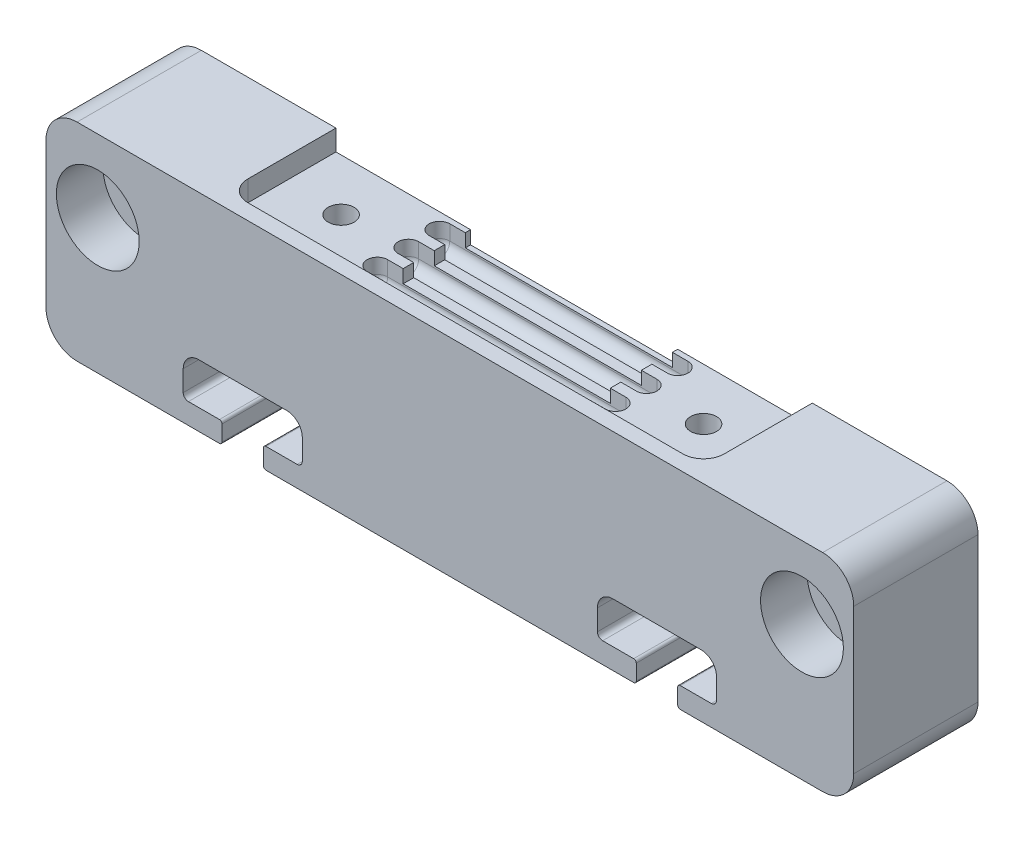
ISO-10303-21;
HEADER;
FILE_DESCRIPTION(('STEP AP214'),'2;1');
FILE_NAME('part.step','',(''),(''),'','','');
FILE_SCHEMA(('AUTOMOTIVE_DESIGN { 1 0 10303 214 1 1 1 1 }'));
ENDSEC;
DATA;
#1=APPLICATION_CONTEXT('core data for automotive mechanical design processes');
#2=APPLICATION_PROTOCOL_DEFINITION('international standard','automotive_design',2000,#1);
#3=PRODUCT_CONTEXT('',#1,'mechanical');
#4=PRODUCT('Part','Part','',(#3));
#5=PRODUCT_RELATED_PRODUCT_CATEGORY('part','',(#4));
#6=PRODUCT_DEFINITION_FORMATION('','',#4);
#7=PRODUCT_DEFINITION_CONTEXT('part definition',#1,'design');
#8=PRODUCT_DEFINITION('design','',#6,#7);
#9=PRODUCT_DEFINITION_SHAPE('','',#8);
#10=(LENGTH_UNIT() NAMED_UNIT(*) SI_UNIT(.MILLI.,.METRE.));
#11=(NAMED_UNIT(*) PLANE_ANGLE_UNIT() SI_UNIT($,.RADIAN.));
#12=(NAMED_UNIT(*) SI_UNIT($,.STERADIAN.) SOLID_ANGLE_UNIT());
#13=UNCERTAINTY_MEASURE_WITH_UNIT(LENGTH_MEASURE(1.E-05),#10,'distance_accuracy_value','');
#14=(GEOMETRIC_REPRESENTATION_CONTEXT(3) GLOBAL_UNCERTAINTY_ASSIGNED_CONTEXT((#13)) GLOBAL_UNIT_ASSIGNED_CONTEXT((#10,
#11,#12)) REPRESENTATION_CONTEXT('',''));
#15=CARTESIAN_POINT('',(0.,0.,0.));
#16=DIRECTION('',(0.,0.,1.));
#17=DIRECTION('',(1.,0.,0.));
#18=AXIS2_PLACEMENT_3D('',#15,#16,#17);
#19=CARTESIAN_POINT('',(36.,20.,12.));
#20=DIRECTION('',(0.,-1.,0.));
#21=DIRECTION('',(0.,0.,-1.));
#22=AXIS2_PLACEMENT_3D('',#19,#20,#21);
#23=PLANE('',#22);
#24=DIRECTION('',(-1.,0.,0.));
#25=VECTOR('',#24,1.);
#26=CARTESIAN_POINT('',(36.,20.,0.));
#27=LINE('',#26,#25);
#28=CARTESIAN_POINT('',(36.,20.,0.));
#29=VERTEX_POINT('',#28);
#30=CARTESIAN_POINT('',(23.,20.,0.));
#31=VERTEX_POINT('',#30);
#32=EDGE_CURVE('E698',#29,#31,#27,.T.);
#33=ORIENTED_EDGE('',*,*,#32,.T.);
#34=DIRECTION('',(0.,0.,-1.));
#35=VECTOR('',#34,1.);
#36=CARTESIAN_POINT('',(23.,20.,8.5));
#37=LINE('',#36,#35);
#38=CARTESIAN_POINT('',(23.,20.,8.5));
#39=VERTEX_POINT('',#38);
#40=EDGE_CURVE('E1480',#39,#31,#37,.T.);
#41=ORIENTED_EDGE('',*,*,#40,.F.);
#42=CARTESIAN_POINT('',(21.,20.,8.5));
#43=DIRECTION('',(0.,1.,0.));
#44=DIRECTION('',(0.,0.,1.));
#45=AXIS2_PLACEMENT_3D('',#42,#43,#44);
#46=CIRCLE('',#45,2.);
#47=CARTESIAN_POINT('',(21.,20.,10.5));
#48=VERTEX_POINT('',#47);
#49=EDGE_CURVE('E1477',#48,#39,#46,.T.);
#50=ORIENTED_EDGE('',*,*,#49,.F.);
#51=DIRECTION('',(1.,0.,0.));
#52=VECTOR('',#51,1.);
#53=CARTESIAN_POINT('',(-21.,20.,10.5));
#54=LINE('',#53,#52);
#55=CARTESIAN_POINT('',(-21.,20.,10.5));
#56=VERTEX_POINT('',#55);
#57=EDGE_CURVE('E1469',#56,#48,#54,.T.);
#58=ORIENTED_EDGE('',*,*,#57,.F.);
#59=CARTESIAN_POINT('',(-21.,20.,8.50000000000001));
#60=DIRECTION('',(0.,1.,0.));
#61=DIRECTION('',(0.,0.,-1.));
#62=AXIS2_PLACEMENT_3D('',#59,#60,#61);
#63=CIRCLE('',#62,2.);
#64=CARTESIAN_POINT('',(-23.,20.,8.50000000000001));
#65=VERTEX_POINT('',#64);
#66=EDGE_CURVE('E1465',#65,#56,#63,.T.);
#67=ORIENTED_EDGE('',*,*,#66,.F.);
#68=DIRECTION('',(0.,0.,1.));
#69=VECTOR('',#68,1.);
#70=CARTESIAN_POINT('',(-23.,20.,8.50000000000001));
#71=LINE('',#70,#69);
#72=CARTESIAN_POINT('',(-23.,20.,0.));
#73=VERTEX_POINT('',#72);
#74=EDGE_CURVE('E1462',#73,#65,#71,.T.);
#75=ORIENTED_EDGE('',*,*,#74,.F.);
#76=CARTESIAN_POINT('',(-36.,20.,0.));
#77=VERTEX_POINT('',#76);
#78=EDGE_CURVE('E697',#73,#77,#27,.T.);
#79=ORIENTED_EDGE('',*,*,#78,.T.);
#80=DIRECTION('',(0.,0.,-1.));
#81=VECTOR('',#80,1.);
#82=CARTESIAN_POINT('',(-36.,20.,12.));
#83=LINE('',#82,#81);
#84=CARTESIAN_POINT('',(-36.,20.,12.));
#85=VERTEX_POINT('',#84);
#86=EDGE_CURVE('E829',#85,#77,#83,.T.);
#87=ORIENTED_EDGE('',*,*,#86,.F.);
#88=DIRECTION('',(-1.,0.,0.));
#89=VECTOR('',#88,1.);
#90=CARTESIAN_POINT('',(36.,20.,12.));
#91=LINE('',#90,#89);
#92=CARTESIAN_POINT('',(36.,20.,12.));
#93=VERTEX_POINT('',#92);
#94=EDGE_CURVE('E616',#93,#85,#91,.T.);
#95=ORIENTED_EDGE('',*,*,#94,.F.);
#96=DIRECTION('',(0.,0.,-1.));
#97=VECTOR('',#96,1.);
#98=CARTESIAN_POINT('',(36.,20.,12.));
#99=LINE('',#98,#97);
#100=EDGE_CURVE('E832',#93,#29,#99,.T.);
#101=ORIENTED_EDGE('',*,*,#100,.T.);
#102=EDGE_LOOP('',(#33,#41,#50,#58,#67,#75,#79,#87,#95,#101));
#103=FACE_BOUND('',#102,.T.);
#104=ADVANCED_FACE('F16',(#103),#23,.F.);
#105=CARTESIAN_POINT('',(-10.,16.73,0.));
#106=DIRECTION('',(-1.,0.,0.));
#107=DIRECTION('',(0.,-1.,0.));
#108=AXIS2_PLACEMENT_3D('',#105,#106,#107);
#109=PLANE('',#108);
#110=DIRECTION('',(0.,1.,0.));
#111=VECTOR('',#110,1.);
#112=CARTESIAN_POINT('',(-10.,16.73,5.49199999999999));
#113=LINE('',#112,#111);
#114=CARTESIAN_POINT('',(-10.,16.73,5.49199999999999));
#115=VERTEX_POINT('',#114);
#116=CARTESIAN_POINT('',(-10.,18.,5.49199999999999));
#117=VERTEX_POINT('',#116);
#118=EDGE_CURVE('E495',#115,#117,#113,.T.);
#119=ORIENTED_EDGE('',*,*,#118,.T.);
#120=DIRECTION('',(0.,0.,1.));
#121=VECTOR('',#120,1.);
#122=CARTESIAN_POINT('',(-10.,18.,0.));
#123=LINE('',#122,#121);
#124=CARTESIAN_POINT('',(-10.,18.,6.50800000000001));
#125=VERTEX_POINT('',#124);
#126=EDGE_CURVE('E1088',#117,#125,#123,.T.);
#127=ORIENTED_EDGE('',*,*,#126,.T.);
#128=DIRECTION('',(0.,-1.,0.));
#129=VECTOR('',#128,1.);
#130=CARTESIAN_POINT('',(-10.,16.73,6.50800000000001));
#131=LINE('',#130,#129);
#132=CARTESIAN_POINT('',(-10.,16.73,6.50800000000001));
#133=VERTEX_POINT('',#132);
#134=EDGE_CURVE('E483',#125,#133,#131,.T.);
#135=ORIENTED_EDGE('',*,*,#134,.T.);
#136=DIRECTION('',(0.,0.,1.));
#137=VECTOR('',#136,1.);
#138=CARTESIAN_POINT('',(-10.,16.73,0.));
#139=LINE('',#138,#137);
#140=EDGE_CURVE('E1089',#115,#133,#139,.T.);
#141=ORIENTED_EDGE('',*,*,#140,.F.);
#142=EDGE_LOOP('',(#119,#127,#135,#141));
#143=FACE_BOUND('',#142,.T.);
#144=ADVANCED_FACE('F1087',(#143),#109,.F.);
#145=CARTESIAN_POINT('',(10.,16.73,0.));
#146=DIRECTION('',(1.,0.,0.));
#147=DIRECTION('',(0.,1.,0.));
#148=AXIS2_PLACEMENT_3D('',#145,#146,#147);
#149=PLANE('',#148);
#150=DIRECTION('',(0.,1.,0.));
#151=VECTOR('',#150,1.);
#152=CARTESIAN_POINT('',(10.,16.73,6.50800000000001));
#153=LINE('',#152,#151);
#154=CARTESIAN_POINT('',(10.,16.73,6.50800000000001));
#155=VERTEX_POINT('',#154);
#156=CARTESIAN_POINT('',(10.,18.,6.50800000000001));
#157=VERTEX_POINT('',#156);
#158=EDGE_CURVE('E480',#155,#157,#153,.T.);
#159=ORIENTED_EDGE('',*,*,#158,.T.);
#160=DIRECTION('',(0.,0.,-1.));
#161=VECTOR('',#160,1.);
#162=CARTESIAN_POINT('',(10.,18.,0.));
#163=LINE('',#162,#161);
#164=CARTESIAN_POINT('',(10.,18.,5.49199999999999));
#165=VERTEX_POINT('',#164);
#166=EDGE_CURVE('E1142',#157,#165,#163,.T.);
#167=ORIENTED_EDGE('',*,*,#166,.T.);
#168=DIRECTION('',(0.,-1.,0.));
#169=VECTOR('',#168,1.);
#170=CARTESIAN_POINT('',(10.,16.73,5.49199999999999));
#171=LINE('',#170,#169);
#172=CARTESIAN_POINT('',(10.,16.73,5.49199999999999));
#173=VERTEX_POINT('',#172);
#174=EDGE_CURVE('E488',#165,#173,#171,.T.);
#175=ORIENTED_EDGE('',*,*,#174,.T.);
#176=DIRECTION('',(0.,0.,-1.));
#177=VECTOR('',#176,1.);
#178=CARTESIAN_POINT('',(10.,16.73,0.));
#179=LINE('',#178,#177);
#180=EDGE_CURVE('E542',#155,#173,#179,.T.);
#181=ORIENTED_EDGE('',*,*,#180,.F.);
#182=EDGE_LOOP('',(#159,#167,#175,#181));
#183=FACE_BOUND('',#182,.T.);
#184=ADVANCED_FACE('F1204',(#183),#149,.F.);
#185=CARTESIAN_POINT('',(-9.,16.73,9.));
#186=DIRECTION('',(0.,1.,0.));
#187=DIRECTION('',(-1.,0.,0.));
#188=AXIS2_PLACEMENT_3D('',#185,#186,#187);
#189=PLANE('',#188);
#190=DIRECTION('',(-1.,0.,0.));
#191=VECTOR('',#190,1.);
#192=CARTESIAN_POINT('',(-9.,16.73,6.50800000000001));
#193=LINE('',#192,#191);
#194=EDGE_CURVE('E910',#155,#133,#193,.T.);
#195=ORIENTED_EDGE('',*,*,#194,.F.);
#196=ORIENTED_EDGE('',*,*,#180,.T.);
#197=DIRECTION('',(1.,0.,0.));
#198=VECTOR('',#197,1.);
#199=CARTESIAN_POINT('',(-9.,16.73,5.49199999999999));
#200=LINE('',#199,#198);
#201=EDGE_CURVE('E889',#115,#173,#200,.T.);
#202=ORIENTED_EDGE('',*,*,#201,.F.);
#203=ORIENTED_EDGE('',*,*,#140,.T.);
#204=EDGE_LOOP('',(#195,#196,#202,#203));
#205=FACE_BOUND('',#204,.T.);
#206=ADVANCED_FACE('F1075',(#205),#189,.T.);
#207=DIRECTION('',(0.,1.,0.));
#208=VECTOR('',#207,1.);
#209=CARTESIAN_POINT('',(-10.,16.73,2.49199999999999));
#210=LINE('',#209,#208);
#211=CARTESIAN_POINT('',(-10.,16.73,2.49199999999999));
#212=VERTEX_POINT('',#211);
#213=CARTESIAN_POINT('',(-10.,18.,2.49199999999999));
#214=VERTEX_POINT('',#213);
#215=EDGE_CURVE('E515',#212,#214,#210,.T.);
#216=ORIENTED_EDGE('',*,*,#215,.T.);
#217=DIRECTION('',(0.,0.,1.));
#218=VECTOR('',#217,1.);
#219=CARTESIAN_POINT('',(-10.,18.,0.));
#220=LINE('',#219,#218);
#221=CARTESIAN_POINT('',(-10.,18.,3.50800000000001));
#222=VERTEX_POINT('',#221);
#223=EDGE_CURVE('E1134',#214,#222,#220,.T.);
#224=ORIENTED_EDGE('',*,*,#223,.T.);
#225=DIRECTION('',(0.,-1.,0.));
#226=VECTOR('',#225,1.);
#227=CARTESIAN_POINT('',(-10.,16.73,3.50800000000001));
#228=LINE('',#227,#226);
#229=CARTESIAN_POINT('',(-10.,16.73,3.50800000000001));
#230=VERTEX_POINT('',#229);
#231=EDGE_CURVE('E501',#222,#230,#228,.T.);
#232=ORIENTED_EDGE('',*,*,#231,.T.);
#233=EDGE_CURVE('E528',#212,#230,#139,.T.);
#234=ORIENTED_EDGE('',*,*,#233,.F.);
#235=EDGE_LOOP('',(#216,#224,#232,#234));
#236=FACE_BOUND('',#235,.T.);
#237=ADVANCED_FACE('F1183',(#236),#109,.F.);
#238=DIRECTION('',(0.,1.,0.));
#239=VECTOR('',#238,1.);
#240=CARTESIAN_POINT('',(10.,16.73,3.50800000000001));
#241=LINE('',#240,#239);
#242=CARTESIAN_POINT('',(10.,16.73,3.50800000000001));
#243=VERTEX_POINT('',#242);
#244=CARTESIAN_POINT('',(10.,18.,3.50800000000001));
#245=VERTEX_POINT('',#244);
#246=EDGE_CURVE('E498',#243,#245,#241,.T.);
#247=ORIENTED_EDGE('',*,*,#246,.T.);
#248=DIRECTION('',(0.,0.,-1.));
#249=VECTOR('',#248,1.);
#250=CARTESIAN_POINT('',(10.,18.,0.));
#251=LINE('',#250,#249);
#252=CARTESIAN_POINT('',(10.,18.,2.49199999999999));
#253=VERTEX_POINT('',#252);
#254=EDGE_CURVE('E946',#245,#253,#251,.T.);
#255=ORIENTED_EDGE('',*,*,#254,.T.);
#256=DIRECTION('',(0.,-1.,0.));
#257=VECTOR('',#256,1.);
#258=CARTESIAN_POINT('',(10.,16.73,2.49199999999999));
#259=LINE('',#258,#257);
#260=CARTESIAN_POINT('',(10.,16.73,2.49199999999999));
#261=VERTEX_POINT('',#260);
#262=EDGE_CURVE('E506',#253,#261,#259,.T.);
#263=ORIENTED_EDGE('',*,*,#262,.T.);
#264=EDGE_CURVE('E1064',#243,#261,#179,.T.);
#265=ORIENTED_EDGE('',*,*,#264,.F.);
#266=EDGE_LOOP('',(#247,#255,#263,#265));
#267=FACE_BOUND('',#266,.T.);
#268=ADVANCED_FACE('F1178',(#267),#149,.F.);
#269=DIRECTION('',(-1.,0.,0.));
#270=VECTOR('',#269,1.);
#271=CARTESIAN_POINT('',(-9.,16.73,3.50800000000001));
#272=LINE('',#271,#270);
#273=EDGE_CURVE('E904',#243,#230,#272,.T.);
#274=ORIENTED_EDGE('',*,*,#273,.F.);
#275=ORIENTED_EDGE('',*,*,#264,.T.);
#276=DIRECTION('',(1.,0.,0.));
#277=VECTOR('',#276,1.);
#278=CARTESIAN_POINT('',(-9.,16.73,2.49199999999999));
#279=LINE('',#278,#277);
#280=EDGE_CURVE('E871',#212,#261,#279,.T.);
#281=ORIENTED_EDGE('',*,*,#280,.F.);
#282=ORIENTED_EDGE('',*,*,#233,.T.);
#283=EDGE_LOOP('',(#274,#275,#281,#282));
#284=FACE_BOUND('',#283,.T.);
#285=ADVANCED_FACE('F1180',(#284),#189,.T.);
#286=DIRECTION('',(0.,1.,0.));
#287=VECTOR('',#286,1.);
#288=CARTESIAN_POINT('',(-10.,16.73,0.));
#289=LINE('',#288,#287);
#290=CARTESIAN_POINT('',(-10.,16.73,0.));
#291=VERTEX_POINT('',#290);
#292=CARTESIAN_POINT('',(-10.,18.,0.));
#293=VERTEX_POINT('',#292);
#294=EDGE_CURVE('E546',#291,#293,#289,.T.);
#295=ORIENTED_EDGE('',*,*,#294,.T.);
#296=DIRECTION('',(0.,0.,1.));
#297=VECTOR('',#296,1.);
#298=CARTESIAN_POINT('',(-10.,18.,0.));
#299=LINE('',#298,#297);
#300=CARTESIAN_POINT('',(-10.,18.,0.508000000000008));
#301=VERTEX_POINT('',#300);
#302=EDGE_CURVE('E944',#293,#301,#299,.T.);
#303=ORIENTED_EDGE('',*,*,#302,.T.);
#304=DIRECTION('',(0.,-1.,0.));
#305=VECTOR('',#304,1.);
#306=CARTESIAN_POINT('',(-10.,16.73,0.508000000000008));
#307=LINE('',#306,#305);
#308=CARTESIAN_POINT('',(-10.,16.73,0.508000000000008));
#309=VERTEX_POINT('',#308);
#310=EDGE_CURVE('E521',#301,#309,#307,.T.);
#311=ORIENTED_EDGE('',*,*,#310,.T.);
#312=EDGE_CURVE('E524',#291,#309,#139,.T.);
#313=ORIENTED_EDGE('',*,*,#312,.F.);
#314=EDGE_LOOP('',(#295,#303,#311,#313));
#315=FACE_BOUND('',#314,.T.);
#316=ADVANCED_FACE('F1294',(#315),#109,.F.);
#317=DIRECTION('',(0.,1.,0.));
#318=VECTOR('',#317,1.);
#319=CARTESIAN_POINT('',(10.,16.73,0.508000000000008));
#320=LINE('',#319,#318);
#321=CARTESIAN_POINT('',(10.,16.73,0.508000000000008));
#322=VERTEX_POINT('',#321);
#323=CARTESIAN_POINT('',(10.,18.,0.508000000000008));
#324=VERTEX_POINT('',#323);
#325=EDGE_CURVE('E518',#322,#324,#320,.T.);
#326=ORIENTED_EDGE('',*,*,#325,.T.);
#327=DIRECTION('',(0.,0.,-1.));
#328=VECTOR('',#327,1.);
#329=CARTESIAN_POINT('',(10.,18.,0.));
#330=LINE('',#329,#328);
#331=CARTESIAN_POINT('',(10.,18.,0.));
#332=VERTEX_POINT('',#331);
#333=EDGE_CURVE('E961',#324,#332,#330,.T.);
#334=ORIENTED_EDGE('',*,*,#333,.T.);
#335=DIRECTION('',(0.,1.,0.));
#336=VECTOR('',#335,1.);
#337=CARTESIAN_POINT('',(10.,16.73,0.));
#338=LINE('',#337,#336);
#339=CARTESIAN_POINT('',(10.,16.73,0.));
#340=VERTEX_POINT('',#339);
#341=EDGE_CURVE('E550',#340,#332,#338,.T.);
#342=ORIENTED_EDGE('',*,*,#341,.F.);
#343=EDGE_CURVE('E537',#322,#340,#179,.T.);
#344=ORIENTED_EDGE('',*,*,#343,.F.);
#345=EDGE_LOOP('',(#326,#334,#342,#344));
#346=FACE_BOUND('',#345,.T.);
#347=ADVANCED_FACE('F1061',(#346),#149,.F.);
#348=DIRECTION('',(-1.,0.,0.));
#349=VECTOR('',#348,1.);
#350=CARTESIAN_POINT('',(-9.,16.73,0.508000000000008));
#351=LINE('',#350,#349);
#352=EDGE_CURVE('E874',#322,#309,#351,.T.);
#353=ORIENTED_EDGE('',*,*,#352,.F.);
#354=ORIENTED_EDGE('',*,*,#343,.T.);
#355=DIRECTION('',(-1.,0.,0.));
#356=VECTOR('',#355,1.);
#357=CARTESIAN_POINT('',(-10.,16.73,0.));
#358=LINE('',#357,#356);
#359=EDGE_CURVE('E541',#340,#291,#358,.T.);
#360=ORIENTED_EDGE('',*,*,#359,.T.);
#361=ORIENTED_EDGE('',*,*,#312,.T.);
#362=EDGE_LOOP('',(#353,#354,#360,#361));
#363=FACE_BOUND('',#362,.T.);
#364=ADVANCED_FACE('F1261',(#363),#189,.T.);
#365=CARTESIAN_POINT('',(15.75,4.5,12.));
#366=DIRECTION('',(0.,0.,-1.));
#367=DIRECTION('',(-1.,0.,0.));
#368=AXIS2_PLACEMENT_3D('',#365,#366,#367);
#369=CYLINDRICAL_SURFACE('',#368,1.5);
#370=CARTESIAN_POINT('',(15.75,4.5,0.));
#371=DIRECTION('',(0.,0.,-1.));
#372=DIRECTION('',(1.,0.,0.));
#373=AXIS2_PLACEMENT_3D('',#370,#371,#372);
#374=CIRCLE('',#373,1.5);
#375=CARTESIAN_POINT('',(14.25,4.5,0.));
#376=VERTEX_POINT('',#375);
#377=CARTESIAN_POINT('',(15.75,6.,0.));
#378=VERTEX_POINT('',#377);
#379=EDGE_CURVE('E587',#376,#378,#374,.T.);
#380=ORIENTED_EDGE('',*,*,#379,.T.);
#381=DIRECTION('',(0.,0.,-1.));
#382=VECTOR('',#381,1.);
#383=CARTESIAN_POINT('',(15.75,6.,12.));
#384=LINE('',#383,#382);
#385=CARTESIAN_POINT('',(15.75,6.,12.));
#386=VERTEX_POINT('',#385);
#387=EDGE_CURVE('E868',#386,#378,#384,.T.);
#388=ORIENTED_EDGE('',*,*,#387,.F.);
#389=CARTESIAN_POINT('',(15.75,4.5,12.));
#390=DIRECTION('',(0.,0.,-1.));
#391=DIRECTION('',(1.,0.,0.));
#392=AXIS2_PLACEMENT_3D('',#389,#390,#391);
#393=CIRCLE('',#392,1.5);
#394=CARTESIAN_POINT('',(14.25,4.5,12.));
#395=VERTEX_POINT('',#394);
#396=EDGE_CURVE('E588',#395,#386,#393,.T.);
#397=ORIENTED_EDGE('',*,*,#396,.F.);
#398=DIRECTION('',(0.,0.,-1.));
#399=VECTOR('',#398,1.);
#400=CARTESIAN_POINT('',(14.25,4.5,12.));
#401=LINE('',#400,#399);
#402=EDGE_CURVE('E670',#395,#376,#401,.T.);
#403=ORIENTED_EDGE('',*,*,#402,.T.);
#404=EDGE_LOOP('',(#380,#388,#397,#403));
#405=FACE_BOUND('',#404,.T.);
#406=ADVANCED_FACE('F1257',(#405),#369,.F.);
#407=CARTESIAN_POINT('',(15.75,6.,12.));
#408=DIRECTION('',(0.,1.,0.));
#409=DIRECTION('',(0.,0.,1.));
#410=AXIS2_PLACEMENT_3D('',#407,#408,#409);
#411=PLANE('',#410);
#412=DIRECTION('',(1.,0.,0.));
#413=VECTOR('',#412,1.);
#414=CARTESIAN_POINT('',(15.75,6.,0.));
#415=LINE('',#414,#413);
#416=CARTESIAN_POINT('',(24.25,6.,0.));
#417=VERTEX_POINT('',#416);
#418=EDGE_CURVE('E673',#378,#417,#415,.T.);
#419=ORIENTED_EDGE('',*,*,#418,.T.);
#420=DIRECTION('',(0.,0.,-1.));
#421=VECTOR('',#420,1.);
#422=CARTESIAN_POINT('',(24.25,6.,12.));
#423=LINE('',#422,#421);
#424=CARTESIAN_POINT('',(24.25,6.,12.));
#425=VERTEX_POINT('',#424);
#426=EDGE_CURVE('E865',#425,#417,#423,.T.);
#427=ORIENTED_EDGE('',*,*,#426,.F.);
#428=DIRECTION('',(1.,0.,0.));
#429=VECTOR('',#428,1.);
#430=CARTESIAN_POINT('',(15.75,6.,12.));
#431=LINE('',#430,#429);
#432=EDGE_CURVE('E591',#386,#425,#431,.T.);
#433=ORIENTED_EDGE('',*,*,#432,.F.);
#434=ORIENTED_EDGE('',*,*,#387,.T.);
#435=EDGE_LOOP('',(#419,#427,#433,#434));
#436=FACE_BOUND('',#435,.T.);
#437=ADVANCED_FACE('F1253',(#436),#411,.F.);
#438=CARTESIAN_POINT('',(24.25,4.5,12.));
#439=DIRECTION('',(0.,0.,-1.));
#440=DIRECTION('',(-1.,0.,0.));
#441=AXIS2_PLACEMENT_3D('',#438,#439,#440);
#442=CYLINDRICAL_SURFACE('',#441,1.5);
#443=CARTESIAN_POINT('',(24.25,4.5,0.));
#444=DIRECTION('',(0.,0.,-1.));
#445=DIRECTION('',(1.,0.,0.));
#446=AXIS2_PLACEMENT_3D('',#443,#444,#445);
#447=CIRCLE('',#446,1.5);
#448=CARTESIAN_POINT('',(25.75,4.5,0.));
#449=VERTEX_POINT('',#448);
#450=EDGE_CURVE('E675',#417,#449,#447,.T.);
#451=ORIENTED_EDGE('',*,*,#450,.T.);
#452=DIRECTION('',(0.,0.,-1.));
#453=VECTOR('',#452,1.);
#454=CARTESIAN_POINT('',(25.75,4.5,12.));
#455=LINE('',#454,#453);
#456=CARTESIAN_POINT('',(25.75,4.5,12.));
#457=VERTEX_POINT('',#456);
#458=EDGE_CURVE('E862',#457,#449,#455,.T.);
#459=ORIENTED_EDGE('',*,*,#458,.F.);
#460=CARTESIAN_POINT('',(24.25,4.5,12.));
#461=DIRECTION('',(0.,0.,-1.));
#462=DIRECTION('',(1.,0.,0.));
#463=AXIS2_PLACEMENT_3D('',#460,#461,#462);
#464=CIRCLE('',#463,1.5);
#465=EDGE_CURVE('E594',#425,#457,#464,.T.);
#466=ORIENTED_EDGE('',*,*,#465,.F.);
#467=ORIENTED_EDGE('',*,*,#426,.T.);
#468=EDGE_LOOP('',(#451,#459,#466,#467));
#469=FACE_BOUND('',#468,.T.);
#470=ADVANCED_FACE('F1249',(#469),#442,.F.);
#471=CARTESIAN_POINT('',(25.75,4.5,12.));
#472=DIRECTION('',(1.,0.,0.));
#473=DIRECTION('',(0.,0.,-1.));
#474=AXIS2_PLACEMENT_3D('',#471,#472,#473);
#475=PLANE('',#474);
#476=DIRECTION('',(0.,-1.,0.));
#477=VECTOR('',#476,1.);
#478=CARTESIAN_POINT('',(25.75,4.5,0.));
#479=LINE('',#478,#477);
#480=CARTESIAN_POINT('',(25.75,2.5,0.));
#481=VERTEX_POINT('',#480);
#482=EDGE_CURVE('E677',#449,#481,#479,.T.);
#483=ORIENTED_EDGE('',*,*,#482,.T.);
#484=DIRECTION('',(0.,0.,-1.));
#485=VECTOR('',#484,1.);
#486=CARTESIAN_POINT('',(25.75,2.5,12.));
#487=LINE('',#486,#485);
#488=CARTESIAN_POINT('',(25.75,2.5,12.));
#489=VERTEX_POINT('',#488);
#490=EDGE_CURVE('E859',#489,#481,#487,.T.);
#491=ORIENTED_EDGE('',*,*,#490,.F.);
#492=DIRECTION('',(0.,-1.,0.));
#493=VECTOR('',#492,1.);
#494=CARTESIAN_POINT('',(25.75,4.5,12.));
#495=LINE('',#494,#493);
#496=EDGE_CURVE('E596',#457,#489,#495,.T.);
#497=ORIENTED_EDGE('',*,*,#496,.F.);
#498=ORIENTED_EDGE('',*,*,#458,.T.);
#499=EDGE_LOOP('',(#483,#491,#497,#498));
#500=FACE_BOUND('',#499,.T.);
#501=ADVANCED_FACE('F1245',(#500),#475,.F.);
#502=CARTESIAN_POINT('',(25.25,2.5,12.));
#503=DIRECTION('',(0.,0.,-1.));
#504=DIRECTION('',(-1.,0.,0.));
#505=AXIS2_PLACEMENT_3D('',#502,#503,#504);
#506=CYLINDRICAL_SURFACE('',#505,0.499999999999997);
#507=CARTESIAN_POINT('',(25.25,2.5,0.));
#508=DIRECTION('',(0.,0.,-1.));
#509=DIRECTION('',(1.,0.,0.));
#510=AXIS2_PLACEMENT_3D('',#507,#508,#509);
#511=CIRCLE('',#510,0.499999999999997);
#512=CARTESIAN_POINT('',(25.25,2.,0.));
#513=VERTEX_POINT('',#512);
#514=EDGE_CURVE('E679',#481,#513,#511,.T.);
#515=ORIENTED_EDGE('',*,*,#514,.T.);
#516=DIRECTION('',(0.,0.,-1.));
#517=VECTOR('',#516,1.);
#518=CARTESIAN_POINT('',(25.25,2.,12.));
#519=LINE('',#518,#517);
#520=CARTESIAN_POINT('',(25.25,2.,12.));
#521=VERTEX_POINT('',#520);
#522=EDGE_CURVE('E856',#521,#513,#519,.T.);
#523=ORIENTED_EDGE('',*,*,#522,.F.);
#524=CARTESIAN_POINT('',(25.25,2.5,12.));
#525=DIRECTION('',(0.,0.,-1.));
#526=DIRECTION('',(1.,0.,0.));
#527=AXIS2_PLACEMENT_3D('',#524,#525,#526);
#528=CIRCLE('',#527,0.499999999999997);
#529=EDGE_CURVE('E598',#489,#521,#528,.T.);
#530=ORIENTED_EDGE('',*,*,#529,.F.);
#531=ORIENTED_EDGE('',*,*,#490,.T.);
#532=EDGE_LOOP('',(#515,#523,#530,#531));
#533=FACE_BOUND('',#532,.T.);
#534=ADVANCED_FACE('F1241',(#533),#506,.F.);
#535=CARTESIAN_POINT('',(25.25,2.,12.));
#536=DIRECTION('',(0.,-1.,0.));
#537=DIRECTION('',(0.,0.,-1.));
#538=AXIS2_PLACEMENT_3D('',#535,#536,#537);
#539=PLANE('',#538);
#540=DIRECTION('',(-1.,0.,0.));
#541=VECTOR('',#540,1.);
#542=CARTESIAN_POINT('',(25.25,2.,0.));
#543=LINE('',#542,#541);
#544=CARTESIAN_POINT('',(22.25,2.,0.));
#545=VERTEX_POINT('',#544);
#546=EDGE_CURVE('E681',#513,#545,#543,.T.);
#547=ORIENTED_EDGE('',*,*,#546,.T.);
#548=DIRECTION('',(0.,0.,-1.));
#549=VECTOR('',#548,1.);
#550=CARTESIAN_POINT('',(22.25,2.,12.));
#551=LINE('',#550,#549);
#552=CARTESIAN_POINT('',(22.25,2.,12.));
#553=VERTEX_POINT('',#552);
#554=EDGE_CURVE('E853',#553,#545,#551,.T.);
#555=ORIENTED_EDGE('',*,*,#554,.F.);
#556=DIRECTION('',(-1.,0.,0.));
#557=VECTOR('',#556,1.);
#558=CARTESIAN_POINT('',(25.25,2.,12.));
#559=LINE('',#558,#557);
#560=EDGE_CURVE('E600',#521,#553,#559,.T.);
#561=ORIENTED_EDGE('',*,*,#560,.F.);
#562=ORIENTED_EDGE('',*,*,#522,.T.);
#563=EDGE_LOOP('',(#547,#555,#561,#562));
#564=FACE_BOUND('',#563,.T.);
#565=ADVANCED_FACE('F1237',(#564),#539,.F.);
#566=CARTESIAN_POINT('',(22.25,1.75,12.));
#567=DIRECTION('',(0.,0.,-1.));
#568=DIRECTION('',(-1.,0.,0.));
#569=AXIS2_PLACEMENT_3D('',#566,#567,#568);
#570=CYLINDRICAL_SURFACE('',#569,0.25);
#571=CARTESIAN_POINT('',(22.25,1.75,0.));
#572=DIRECTION('',(0.,0.,1.));
#573=DIRECTION('',(1.,0.,0.));
#574=AXIS2_PLACEMENT_3D('',#571,#572,#573);
#575=CIRCLE('',#574,0.25);
#576=CARTESIAN_POINT('',(22.,1.75,0.));
#577=VERTEX_POINT('',#576);
#578=EDGE_CURVE('E683',#545,#577,#575,.T.);
#579=ORIENTED_EDGE('',*,*,#578,.T.);
#580=DIRECTION('',(0.,0.,-1.));
#581=VECTOR('',#580,1.);
#582=CARTESIAN_POINT('',(22.,1.75,12.));
#583=LINE('',#582,#581);
#584=CARTESIAN_POINT('',(22.,1.75,12.));
#585=VERTEX_POINT('',#584);
#586=EDGE_CURVE('E850',#585,#577,#583,.T.);
#587=ORIENTED_EDGE('',*,*,#586,.F.);
#588=CARTESIAN_POINT('',(22.25,1.75,12.));
#589=DIRECTION('',(0.,0.,1.));
#590=DIRECTION('',(1.,0.,0.));
#591=AXIS2_PLACEMENT_3D('',#588,#589,#590);
#592=CIRCLE('',#591,0.25);
#593=EDGE_CURVE('E602',#553,#585,#592,.T.);
#594=ORIENTED_EDGE('',*,*,#593,.F.);
#595=ORIENTED_EDGE('',*,*,#554,.T.);
#596=EDGE_LOOP('',(#579,#587,#594,#595));
#597=FACE_BOUND('',#596,.T.);
#598=ADVANCED_FACE('F1233',(#597),#570,.T.);
#599=CARTESIAN_POINT('',(22.,1.75,12.));
#600=DIRECTION('',(1.,0.,0.));
#601=DIRECTION('',(0.,0.,-1.));
#602=AXIS2_PLACEMENT_3D('',#599,#600,#601);
#603=PLANE('',#602);
#604=DIRECTION('',(0.,-1.,0.));
#605=VECTOR('',#604,1.);
#606=CARTESIAN_POINT('',(22.,1.75,0.));
#607=LINE('',#606,#605);
#608=CARTESIAN_POINT('',(22.,0.25,0.));
#609=VERTEX_POINT('',#608);
#610=EDGE_CURVE('E685',#577,#609,#607,.T.);
#611=ORIENTED_EDGE('',*,*,#610,.T.);
#612=DIRECTION('',(0.,0.,-1.));
#613=VECTOR('',#612,1.);
#614=CARTESIAN_POINT('',(22.,0.25,12.));
#615=LINE('',#614,#613);
#616=CARTESIAN_POINT('',(22.,0.25,12.));
#617=VERTEX_POINT('',#616);
#618=EDGE_CURVE('E847',#617,#609,#615,.T.);
#619=ORIENTED_EDGE('',*,*,#618,.F.);
#620=DIRECTION('',(0.,-1.,0.));
#621=VECTOR('',#620,1.);
#622=CARTESIAN_POINT('',(22.,1.75,12.));
#623=LINE('',#622,#621);
#624=EDGE_CURVE('E604',#585,#617,#623,.T.);
#625=ORIENTED_EDGE('',*,*,#624,.F.);
#626=ORIENTED_EDGE('',*,*,#586,.T.);
#627=EDGE_LOOP('',(#611,#619,#625,#626));
#628=FACE_BOUND('',#627,.T.);
#629=ADVANCED_FACE('F1229',(#628),#603,.F.);
#630=CARTESIAN_POINT('',(22.25,0.25,12.));
#631=DIRECTION('',(0.,0.,-1.));
#632=DIRECTION('',(-1.,0.,0.));
#633=AXIS2_PLACEMENT_3D('',#630,#631,#632);
#634=CYLINDRICAL_SURFACE('',#633,0.25);
#635=CARTESIAN_POINT('',(22.25,0.25,0.));
#636=DIRECTION('',(0.,0.,1.));
#637=DIRECTION('',(1.,0.,0.));
#638=AXIS2_PLACEMENT_3D('',#635,#636,#637);
#639=CIRCLE('',#638,0.25);
#640=CARTESIAN_POINT('',(22.25,0.,0.));
#641=VERTEX_POINT('',#640);
#642=EDGE_CURVE('E687',#609,#641,#639,.T.);
#643=ORIENTED_EDGE('',*,*,#642,.T.);
#644=DIRECTION('',(0.,0.,-1.));
#645=VECTOR('',#644,1.);
#646=CARTESIAN_POINT('',(22.25,0.,12.));
#647=LINE('',#646,#645);
#648=CARTESIAN_POINT('',(22.25,0.,12.));
#649=VERTEX_POINT('',#648);
#650=EDGE_CURVE('E844',#649,#641,#647,.T.);
#651=ORIENTED_EDGE('',*,*,#650,.F.);
#652=CARTESIAN_POINT('',(22.25,0.25,12.));
#653=DIRECTION('',(0.,0.,1.));
#654=DIRECTION('',(1.,0.,0.));
#655=AXIS2_PLACEMENT_3D('',#652,#653,#654);
#656=CIRCLE('',#655,0.25);
#657=EDGE_CURVE('E606',#617,#649,#656,.T.);
#658=ORIENTED_EDGE('',*,*,#657,.F.);
#659=ORIENTED_EDGE('',*,*,#618,.T.);
#660=EDGE_LOOP('',(#643,#651,#658,#659));
#661=FACE_BOUND('',#660,.T.);
#662=ADVANCED_FACE('F1225',(#661),#634,.T.);
#663=CARTESIAN_POINT('',(22.25,0.,12.));
#664=DIRECTION('',(0.,1.,0.));
#665=DIRECTION('',(-1.,0.,0.));
#666=AXIS2_PLACEMENT_3D('',#663,#664,#665);
#667=PLANE('',#666);
#668=DIRECTION('',(1.,0.,0.));
#669=VECTOR('',#668,1.);
#670=CARTESIAN_POINT('',(22.25,0.,0.));
#671=LINE('',#670,#669);
#672=CARTESIAN_POINT('',(36.,0.,0.));
#673=VERTEX_POINT('',#672);
#674=EDGE_CURVE('E689',#641,#673,#671,.T.);
#675=ORIENTED_EDGE('',*,*,#674,.T.);
#676=DIRECTION('',(0.,0.,-1.));
#677=VECTOR('',#676,1.);
#678=CARTESIAN_POINT('',(36.,0.,12.));
#679=LINE('',#678,#677);
#680=CARTESIAN_POINT('',(36.,0.,12.));
#681=VERTEX_POINT('',#680);
#682=EDGE_CURVE('E841',#681,#673,#679,.T.);
#683=ORIENTED_EDGE('',*,*,#682,.F.);
#684=DIRECTION('',(1.,0.,0.));
#685=VECTOR('',#684,1.);
#686=CARTESIAN_POINT('',(22.25,0.,12.));
#687=LINE('',#686,#685);
#688=EDGE_CURVE('E608',#649,#681,#687,.T.);
#689=ORIENTED_EDGE('',*,*,#688,.F.);
#690=ORIENTED_EDGE('',*,*,#650,.T.);
#691=EDGE_LOOP('',(#675,#683,#689,#690));
#692=FACE_BOUND('',#691,.T.);
#693=ADVANCED_FACE('F1221',(#692),#667,.F.);
#694=CARTESIAN_POINT('',(36.,3.,12.));
#695=DIRECTION('',(0.,0.,-1.));
#696=DIRECTION('',(-1.,0.,0.));
#697=AXIS2_PLACEMENT_3D('',#694,#695,#696);
#698=CYLINDRICAL_SURFACE('',#697,3.);
#699=CARTESIAN_POINT('',(36.,3.,0.));
#700=DIRECTION('',(0.,0.,1.));
#701=DIRECTION('',(1.,0.,0.));
#702=AXIS2_PLACEMENT_3D('',#699,#700,#701);
#703=CIRCLE('',#702,3.);
#704=CARTESIAN_POINT('',(39.,3.,0.));
#705=VERTEX_POINT('',#704);
#706=EDGE_CURVE('E691',#673,#705,#703,.T.);
#707=ORIENTED_EDGE('',*,*,#706,.T.);
#708=DIRECTION('',(0.,0.,-1.));
#709=VECTOR('',#708,1.);
#710=CARTESIAN_POINT('',(39.,3.,12.));
#711=LINE('',#710,#709);
#712=CARTESIAN_POINT('',(39.,3.,12.));
#713=VERTEX_POINT('',#712);
#714=EDGE_CURVE('E838',#713,#705,#711,.T.);
#715=ORIENTED_EDGE('',*,*,#714,.F.);
#716=CARTESIAN_POINT('',(36.,3.,12.));
#717=DIRECTION('',(0.,0.,1.));
#718=DIRECTION('',(1.,0.,0.));
#719=AXIS2_PLACEMENT_3D('',#716,#717,#718);
#720=CIRCLE('',#719,3.);
#721=EDGE_CURVE('E610',#681,#713,#720,.T.);
#722=ORIENTED_EDGE('',*,*,#721,.F.);
#723=ORIENTED_EDGE('',*,*,#682,.T.);
#724=EDGE_LOOP('',(#707,#715,#722,#723));
#725=FACE_BOUND('',#724,.T.);
#726=ADVANCED_FACE('F1217',(#725),#698,.T.);
#727=CARTESIAN_POINT('',(39.,3.,12.));
#728=DIRECTION('',(-1.,0.,0.));
#729=DIRECTION('',(0.,0.,1.));
#730=AXIS2_PLACEMENT_3D('',#727,#728,#729);
#731=PLANE('',#730);
#732=DIRECTION('',(0.,1.,0.));
#733=VECTOR('',#732,1.);
#734=CARTESIAN_POINT('',(39.,3.,0.));
#735=LINE('',#734,#733);
#736=CARTESIAN_POINT('',(39.,17.,0.));
#737=VERTEX_POINT('',#736);
#738=EDGE_CURVE('E693',#705,#737,#735,.T.);
#739=ORIENTED_EDGE('',*,*,#738,.T.);
#740=DIRECTION('',(0.,0.,-1.));
#741=VECTOR('',#740,1.);
#742=CARTESIAN_POINT('',(39.,17.,12.));
#743=LINE('',#742,#741);
#744=CARTESIAN_POINT('',(39.,17.,12.));
#745=VERTEX_POINT('',#744);
#746=EDGE_CURVE('E835',#745,#737,#743,.T.);
#747=ORIENTED_EDGE('',*,*,#746,.F.);
#748=DIRECTION('',(0.,1.,0.));
#749=VECTOR('',#748,1.);
#750=CARTESIAN_POINT('',(39.,3.,12.));
#751=LINE('',#750,#749);
#752=EDGE_CURVE('E612',#713,#745,#751,.T.);
#753=ORIENTED_EDGE('',*,*,#752,.F.);
#754=ORIENTED_EDGE('',*,*,#714,.T.);
#755=EDGE_LOOP('',(#739,#747,#753,#754));
#756=FACE_BOUND('',#755,.T.);
#757=ADVANCED_FACE('F1213',(#756),#731,.F.);
#758=CARTESIAN_POINT('',(36.,17.,12.));
#759=DIRECTION('',(0.,0.,-1.));
#760=DIRECTION('',(-1.,0.,0.));
#761=AXIS2_PLACEMENT_3D('',#758,#759,#760);
#762=CYLINDRICAL_SURFACE('',#761,3.);
#763=CARTESIAN_POINT('',(36.,17.,0.));
#764=DIRECTION('',(0.,0.,1.));
#765=DIRECTION('',(1.,0.,0.));
#766=AXIS2_PLACEMENT_3D('',#763,#764,#765);
#767=CIRCLE('',#766,3.);
#768=EDGE_CURVE('E695',#737,#29,#767,.T.);
#769=ORIENTED_EDGE('',*,*,#768,.T.);
#770=ORIENTED_EDGE('',*,*,#100,.F.);
#771=CARTESIAN_POINT('',(36.,17.,12.));
#772=DIRECTION('',(0.,0.,1.));
#773=DIRECTION('',(1.,0.,0.));
#774=AXIS2_PLACEMENT_3D('',#771,#772,#773);
#775=CIRCLE('',#774,3.);
#776=EDGE_CURVE('E614',#745,#93,#775,.T.);
#777=ORIENTED_EDGE('',*,*,#776,.F.);
#778=ORIENTED_EDGE('',*,*,#746,.T.);
#779=EDGE_LOOP('',(#769,#770,#777,#778));
#780=FACE_BOUND('',#779,.T.);
#781=ADVANCED_FACE('F1210',(#780),#762,.T.);
#782=CARTESIAN_POINT('',(-36.,17.,12.));
#783=DIRECTION('',(0.,0.,-1.));
#784=DIRECTION('',(-1.,0.,0.));
#785=AXIS2_PLACEMENT_3D('',#782,#783,#784);
#786=CYLINDRICAL_SURFACE('',#785,3.);
#787=CARTESIAN_POINT('',(-36.,17.,0.));
#788=DIRECTION('',(0.,0.,1.));
#789=DIRECTION('',(-1.,0.,0.));
#790=AXIS2_PLACEMENT_3D('',#787,#788,#789);
#791=CIRCLE('',#790,3.);
#792=CARTESIAN_POINT('',(-39.,17.,0.));
#793=VERTEX_POINT('',#792);
#794=EDGE_CURVE('E701',#77,#793,#791,.T.);
#795=ORIENTED_EDGE('',*,*,#794,.T.);
#796=DIRECTION('',(0.,0.,-1.));
#797=VECTOR('',#796,1.);
#798=CARTESIAN_POINT('',(-39.,17.,12.));
#799=LINE('',#798,#797);
#800=CARTESIAN_POINT('',(-39.,17.,12.));
#801=VERTEX_POINT('',#800);
#802=EDGE_CURVE('E826',#801,#793,#799,.T.);
#803=ORIENTED_EDGE('',*,*,#802,.F.);
#804=CARTESIAN_POINT('',(-36.,17.,12.));
#805=DIRECTION('',(0.,0.,1.));
#806=DIRECTION('',(-1.,0.,0.));
#807=AXIS2_PLACEMENT_3D('',#804,#805,#806);
#808=CIRCLE('',#807,3.);
#809=EDGE_CURVE('E618',#85,#801,#808,.T.);
#810=ORIENTED_EDGE('',*,*,#809,.F.);
#811=ORIENTED_EDGE('',*,*,#86,.T.);
#812=EDGE_LOOP('',(#795,#803,#810,#811));
#813=FACE_BOUND('',#812,.T.);
#814=ADVANCED_FACE('F1208',(#813),#786,.T.);
#815=CARTESIAN_POINT('',(-39.,3.,12.));
#816=DIRECTION('',(1.,0.,0.));
#817=DIRECTION('',(0.,0.,-1.));
#818=AXIS2_PLACEMENT_3D('',#815,#816,#817);
#819=PLANE('',#818);
#820=DIRECTION('',(0.,-1.,0.));
#821=VECTOR('',#820,1.);
#822=CARTESIAN_POINT('',(-39.,3.,0.));
#823=LINE('',#822,#821);
#824=CARTESIAN_POINT('',(-39.,3.,0.));
#825=VERTEX_POINT('',#824);
#826=EDGE_CURVE('E703',#793,#825,#823,.T.);
#827=ORIENTED_EDGE('',*,*,#826,.T.);
#828=DIRECTION('',(0.,0.,-1.));
#829=VECTOR('',#828,1.);
#830=CARTESIAN_POINT('',(-39.,3.,12.));
#831=LINE('',#830,#829);
#832=CARTESIAN_POINT('',(-39.,3.,12.));
#833=VERTEX_POINT('',#832);
#834=EDGE_CURVE('E823',#833,#825,#831,.T.);
#835=ORIENTED_EDGE('',*,*,#834,.F.);
#836=DIRECTION('',(0.,-1.,0.));
#837=VECTOR('',#836,1.);
#838=CARTESIAN_POINT('',(-39.,3.,12.));
#839=LINE('',#838,#837);
#840=EDGE_CURVE('E620',#801,#833,#839,.T.);
#841=ORIENTED_EDGE('',*,*,#840,.F.);
#842=ORIENTED_EDGE('',*,*,#802,.T.);
#843=EDGE_LOOP('',(#827,#835,#841,#842));
#844=FACE_BOUND('',#843,.T.);
#845=ADVANCED_FACE('F1420',(#844),#819,.F.);
#846=CARTESIAN_POINT('',(-36.,3.,12.));
#847=DIRECTION('',(0.,0.,-1.));
#848=DIRECTION('',(-1.,0.,0.));
#849=AXIS2_PLACEMENT_3D('',#846,#847,#848);
#850=CYLINDRICAL_SURFACE('',#849,3.);
#851=CARTESIAN_POINT('',(-36.,3.,0.));
#852=DIRECTION('',(0.,0.,1.));
#853=DIRECTION('',(-1.,0.,0.));
#854=AXIS2_PLACEMENT_3D('',#851,#852,#853);
#855=CIRCLE('',#854,3.);
#856=CARTESIAN_POINT('',(-36.,0.,0.));
#857=VERTEX_POINT('',#856);
#858=EDGE_CURVE('E705',#825,#857,#855,.T.);
#859=ORIENTED_EDGE('',*,*,#858,.T.);
#860=DIRECTION('',(0.,0.,-1.));
#861=VECTOR('',#860,1.);
#862=CARTESIAN_POINT('',(-36.,0.,12.));
#863=LINE('',#862,#861);
#864=CARTESIAN_POINT('',(-36.,0.,12.));
#865=VERTEX_POINT('',#864);
#866=EDGE_CURVE('E820',#865,#857,#863,.T.);
#867=ORIENTED_EDGE('',*,*,#866,.F.);
#868=CARTESIAN_POINT('',(-36.,3.,12.));
#869=DIRECTION('',(0.,0.,1.));
#870=DIRECTION('',(-1.,0.,0.));
#871=AXIS2_PLACEMENT_3D('',#868,#869,#870);
#872=CIRCLE('',#871,3.);
#873=EDGE_CURVE('E622',#833,#865,#872,.T.);
#874=ORIENTED_EDGE('',*,*,#873,.F.);
#875=ORIENTED_EDGE('',*,*,#834,.T.);
#876=EDGE_LOOP('',(#859,#867,#874,#875));
#877=FACE_BOUND('',#876,.T.);
#878=ADVANCED_FACE('F1417',(#877),#850,.T.);
#879=CARTESIAN_POINT('',(-22.25,0.,12.));
#880=DIRECTION('',(0.,1.,0.));
#881=DIRECTION('',(-1.,0.,0.));
#882=AXIS2_PLACEMENT_3D('',#879,#880,#881);
#883=PLANE('',#882);
#884=DIRECTION('',(1.,0.,0.));
#885=VECTOR('',#884,1.);
#886=CARTESIAN_POINT('',(-22.25,0.,0.));
#887=LINE('',#886,#885);
#888=CARTESIAN_POINT('',(-22.25,0.,0.));
#889=VERTEX_POINT('',#888);
#890=EDGE_CURVE('E707',#857,#889,#887,.T.);
#891=ORIENTED_EDGE('',*,*,#890,.T.);
#892=DIRECTION('',(0.,0.,-1.));
#893=VECTOR('',#892,1.);
#894=CARTESIAN_POINT('',(-22.25,0.,12.));
#895=LINE('',#894,#893);
#896=CARTESIAN_POINT('',(-22.25,0.,12.));
#897=VERTEX_POINT('',#896);
#898=EDGE_CURVE('E817',#897,#889,#895,.T.);
#899=ORIENTED_EDGE('',*,*,#898,.F.);
#900=DIRECTION('',(1.,0.,0.));
#901=VECTOR('',#900,1.);
#902=CARTESIAN_POINT('',(-22.25,0.,12.));
#903=LINE('',#902,#901);
#904=EDGE_CURVE('E624',#865,#897,#903,.T.);
#905=ORIENTED_EDGE('',*,*,#904,.F.);
#906=ORIENTED_EDGE('',*,*,#866,.T.);
#907=EDGE_LOOP('',(#891,#899,#905,#906));
#908=FACE_BOUND('',#907,.T.);
#909=ADVANCED_FACE('F1413',(#908),#883,.F.);
#910=CARTESIAN_POINT('',(-22.25,0.250000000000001,12.));
#911=DIRECTION('',(0.,0.,-1.));
#912=DIRECTION('',(-1.,0.,0.));
#913=AXIS2_PLACEMENT_3D('',#910,#911,#912);
#914=CYLINDRICAL_SURFACE('',#913,0.25);
#915=CARTESIAN_POINT('',(-22.25,0.250000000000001,0.));
#916=DIRECTION('',(0.,0.,1.));
#917=DIRECTION('',(-1.,0.,0.));
#918=AXIS2_PLACEMENT_3D('',#915,#916,#917);
#919=CIRCLE('',#918,0.25);
#920=CARTESIAN_POINT('',(-22.,0.250000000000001,0.));
#921=VERTEX_POINT('',#920);
#922=EDGE_CURVE('E709',#889,#921,#919,.T.);
#923=ORIENTED_EDGE('',*,*,#922,.T.);
#924=DIRECTION('',(0.,0.,-1.));
#925=VECTOR('',#924,1.);
#926=CARTESIAN_POINT('',(-22.,0.250000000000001,12.));
#927=LINE('',#926,#925);
#928=CARTESIAN_POINT('',(-22.,0.250000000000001,12.));
#929=VERTEX_POINT('',#928);
#930=EDGE_CURVE('E814',#929,#921,#927,.T.);
#931=ORIENTED_EDGE('',*,*,#930,.F.);
#932=CARTESIAN_POINT('',(-22.25,0.250000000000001,12.));
#933=DIRECTION('',(0.,0.,1.));
#934=DIRECTION('',(-1.,0.,0.));
#935=AXIS2_PLACEMENT_3D('',#932,#933,#934);
#936=CIRCLE('',#935,0.25);
#937=EDGE_CURVE('E626',#897,#929,#936,.T.);
#938=ORIENTED_EDGE('',*,*,#937,.F.);
#939=ORIENTED_EDGE('',*,*,#898,.T.);
#940=EDGE_LOOP('',(#923,#931,#938,#939));
#941=FACE_BOUND('',#940,.T.);
#942=ADVANCED_FACE('F1409',(#941),#914,.T.);
#943=CARTESIAN_POINT('',(-22.,1.75,12.));
#944=DIRECTION('',(-1.,0.,0.));
#945=DIRECTION('',(0.,0.,1.));
#946=AXIS2_PLACEMENT_3D('',#943,#944,#945);
#947=PLANE('',#946);
#948=DIRECTION('',(0.,1.,0.));
#949=VECTOR('',#948,1.);
#950=CARTESIAN_POINT('',(-22.,1.75,0.));
#951=LINE('',#950,#949);
#952=CARTESIAN_POINT('',(-22.,1.75,0.));
#953=VERTEX_POINT('',#952);
#954=EDGE_CURVE('E711',#921,#953,#951,.T.);
#955=ORIENTED_EDGE('',*,*,#954,.T.);
#956=DIRECTION('',(0.,0.,-1.));
#957=VECTOR('',#956,1.);
#958=CARTESIAN_POINT('',(-22.,1.75,12.));
#959=LINE('',#958,#957);
#960=CARTESIAN_POINT('',(-22.,1.75,12.));
#961=VERTEX_POINT('',#960);
#962=EDGE_CURVE('E811',#961,#953,#959,.T.);
#963=ORIENTED_EDGE('',*,*,#962,.F.);
#964=DIRECTION('',(0.,1.,0.));
#965=VECTOR('',#964,1.);
#966=CARTESIAN_POINT('',(-22.,1.75,12.));
#967=LINE('',#966,#965);
#968=EDGE_CURVE('E628',#929,#961,#967,.T.);
#969=ORIENTED_EDGE('',*,*,#968,.F.);
#970=ORIENTED_EDGE('',*,*,#930,.T.);
#971=EDGE_LOOP('',(#955,#963,#969,#970));
#972=FACE_BOUND('',#971,.T.);
#973=ADVANCED_FACE('F1405',(#972),#947,.F.);
#974=CARTESIAN_POINT('',(-22.25,1.75,12.));
#975=DIRECTION('',(0.,0.,-1.));
#976=DIRECTION('',(-1.,0.,0.));
#977=AXIS2_PLACEMENT_3D('',#974,#975,#976);
#978=CYLINDRICAL_SURFACE('',#977,0.25);
#979=CARTESIAN_POINT('',(-22.25,1.75,0.));
#980=DIRECTION('',(0.,0.,1.));
#981=DIRECTION('',(-1.,0.,0.));
#982=AXIS2_PLACEMENT_3D('',#979,#980,#981);
#983=CIRCLE('',#982,0.25);
#984=CARTESIAN_POINT('',(-22.25,2.,0.));
#985=VERTEX_POINT('',#984);
#986=EDGE_CURVE('E713',#953,#985,#983,.T.);
#987=ORIENTED_EDGE('',*,*,#986,.T.);
#988=DIRECTION('',(0.,0.,-1.));
#989=VECTOR('',#988,1.);
#990=CARTESIAN_POINT('',(-22.25,2.,12.));
#991=LINE('',#990,#989);
#992=CARTESIAN_POINT('',(-22.25,2.,12.));
#993=VERTEX_POINT('',#992);
#994=EDGE_CURVE('E808',#993,#985,#991,.T.);
#995=ORIENTED_EDGE('',*,*,#994,.F.);
#996=CARTESIAN_POINT('',(-22.25,1.75,12.));
#997=DIRECTION('',(0.,0.,1.));
#998=DIRECTION('',(-1.,0.,0.));
#999=AXIS2_PLACEMENT_3D('',#996,#997,#998);
#1000=CIRCLE('',#999,0.25);
#1001=EDGE_CURVE('E630',#961,#993,#1000,.T.);
#1002=ORIENTED_EDGE('',*,*,#1001,.F.);
#1003=ORIENTED_EDGE('',*,*,#962,.T.);
#1004=EDGE_LOOP('',(#987,#995,#1002,#1003));
#1005=FACE_BOUND('',#1004,.T.);
#1006=ADVANCED_FACE('F1401',(#1005),#978,.T.);
#1007=CARTESIAN_POINT('',(-25.25,2.,12.));
#1008=DIRECTION('',(0.,-1.,0.));
#1009=DIRECTION('',(1.,0.,0.));
#1010=AXIS2_PLACEMENT_3D('',#1007,#1008,#1009);
#1011=PLANE('',#1010);
#1012=DIRECTION('',(-1.,0.,0.));
#1013=VECTOR('',#1012,1.);
#1014=CARTESIAN_POINT('',(-25.25,2.,0.));
#1015=LINE('',#1014,#1013);
#1016=CARTESIAN_POINT('',(-25.25,2.,0.));
#1017=VERTEX_POINT('',#1016);
#1018=EDGE_CURVE('E715',#985,#1017,#1015,.T.);
#1019=ORIENTED_EDGE('',*,*,#1018,.T.);
#1020=DIRECTION('',(0.,0.,-1.));
#1021=VECTOR('',#1020,1.);
#1022=CARTESIAN_POINT('',(-25.25,2.,12.));
#1023=LINE('',#1022,#1021);
#1024=CARTESIAN_POINT('',(-25.25,2.,12.));
#1025=VERTEX_POINT('',#1024);
#1026=EDGE_CURVE('E805',#1025,#1017,#1023,.T.);
#1027=ORIENTED_EDGE('',*,*,#1026,.F.);
#1028=DIRECTION('',(-1.,0.,0.));
#1029=VECTOR('',#1028,1.);
#1030=CARTESIAN_POINT('',(-25.25,2.,12.));
#1031=LINE('',#1030,#1029);
#1032=EDGE_CURVE('E632',#993,#1025,#1031,.T.);
#1033=ORIENTED_EDGE('',*,*,#1032,.F.);
#1034=ORIENTED_EDGE('',*,*,#994,.T.);
#1035=EDGE_LOOP('',(#1019,#1027,#1033,#1034));
#1036=FACE_BOUND('',#1035,.T.);
#1037=ADVANCED_FACE('F1397',(#1036),#1011,.F.);
#1038=CARTESIAN_POINT('',(-25.25,2.5,12.));
#1039=DIRECTION('',(0.,0.,-1.));
#1040=DIRECTION('',(-1.,0.,0.));
#1041=AXIS2_PLACEMENT_3D('',#1038,#1039,#1040);
#1042=CYLINDRICAL_SURFACE('',#1041,0.499999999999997);
#1043=CARTESIAN_POINT('',(-25.25,2.5,0.));
#1044=DIRECTION('',(0.,0.,-1.));
#1045=DIRECTION('',(-1.,0.,0.));
#1046=AXIS2_PLACEMENT_3D('',#1043,#1044,#1045);
#1047=CIRCLE('',#1046,0.499999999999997);
#1048=CARTESIAN_POINT('',(-25.75,2.5,0.));
#1049=VERTEX_POINT('',#1048);
#1050=EDGE_CURVE('E717',#1017,#1049,#1047,.T.);
#1051=ORIENTED_EDGE('',*,*,#1050,.T.);
#1052=DIRECTION('',(0.,0.,-1.));
#1053=VECTOR('',#1052,1.);
#1054=CARTESIAN_POINT('',(-25.75,2.5,12.));
#1055=LINE('',#1054,#1053);
#1056=CARTESIAN_POINT('',(-25.75,2.5,12.));
#1057=VERTEX_POINT('',#1056);
#1058=EDGE_CURVE('E802',#1057,#1049,#1055,.T.);
#1059=ORIENTED_EDGE('',*,*,#1058,.F.);
#1060=CARTESIAN_POINT('',(-25.25,2.5,12.));
#1061=DIRECTION('',(0.,0.,-1.));
#1062=DIRECTION('',(-1.,0.,0.));
#1063=AXIS2_PLACEMENT_3D('',#1060,#1061,#1062);
#1064=CIRCLE('',#1063,0.499999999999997);
#1065=EDGE_CURVE('E634',#1025,#1057,#1064,.T.);
#1066=ORIENTED_EDGE('',*,*,#1065,.F.);
#1067=ORIENTED_EDGE('',*,*,#1026,.T.);
#1068=EDGE_LOOP('',(#1051,#1059,#1066,#1067));
#1069=FACE_BOUND('',#1068,.T.);
#1070=ADVANCED_FACE('F1393',(#1069),#1042,.F.);
#1071=CARTESIAN_POINT('',(-25.75,4.5,12.));
#1072=DIRECTION('',(-1.,0.,0.));
#1073=DIRECTION('',(0.,0.,1.));
#1074=AXIS2_PLACEMENT_3D('',#1071,#1072,#1073);
#1075=PLANE('',#1074);
#1076=DIRECTION('',(0.,1.,0.));
#1077=VECTOR('',#1076,1.);
#1078=CARTESIAN_POINT('',(-25.75,4.5,0.));
#1079=LINE('',#1078,#1077);
#1080=CARTESIAN_POINT('',(-25.75,4.5,0.));
#1081=VERTEX_POINT('',#1080);
#1082=EDGE_CURVE('E719',#1049,#1081,#1079,.T.);
#1083=ORIENTED_EDGE('',*,*,#1082,.T.);
#1084=DIRECTION('',(0.,0.,-1.));
#1085=VECTOR('',#1084,1.);
#1086=CARTESIAN_POINT('',(-25.75,4.5,12.));
#1087=LINE('',#1086,#1085);
#1088=CARTESIAN_POINT('',(-25.75,4.5,12.));
#1089=VERTEX_POINT('',#1088);
#1090=EDGE_CURVE('E799',#1089,#1081,#1087,.T.);
#1091=ORIENTED_EDGE('',*,*,#1090,.F.);
#1092=DIRECTION('',(0.,1.,0.));
#1093=VECTOR('',#1092,1.);
#1094=CARTESIAN_POINT('',(-25.75,4.5,12.));
#1095=LINE('',#1094,#1093);
#1096=EDGE_CURVE('E636',#1057,#1089,#1095,.T.);
#1097=ORIENTED_EDGE('',*,*,#1096,.F.);
#1098=ORIENTED_EDGE('',*,*,#1058,.T.);
#1099=EDGE_LOOP('',(#1083,#1091,#1097,#1098));
#1100=FACE_BOUND('',#1099,.T.);
#1101=ADVANCED_FACE('F1389',(#1100),#1075,.F.);
#1102=CARTESIAN_POINT('',(-24.25,4.5,12.));
#1103=DIRECTION('',(0.,0.,-1.));
#1104=DIRECTION('',(-1.,0.,0.));
#1105=AXIS2_PLACEMENT_3D('',#1102,#1103,#1104);
#1106=CYLINDRICAL_SURFACE('',#1105,1.5);
#1107=CARTESIAN_POINT('',(-24.25,4.5,0.));
#1108=DIRECTION('',(0.,0.,-1.));
#1109=DIRECTION('',(-1.,0.,0.));
#1110=AXIS2_PLACEMENT_3D('',#1107,#1108,#1109);
#1111=CIRCLE('',#1110,1.5);
#1112=CARTESIAN_POINT('',(-24.25,6.,0.));
#1113=VERTEX_POINT('',#1112);
#1114=EDGE_CURVE('E721',#1081,#1113,#1111,.T.);
#1115=ORIENTED_EDGE('',*,*,#1114,.T.);
#1116=DIRECTION('',(0.,0.,-1.));
#1117=VECTOR('',#1116,1.);
#1118=CARTESIAN_POINT('',(-24.25,6.,12.));
#1119=LINE('',#1118,#1117);
#1120=CARTESIAN_POINT('',(-24.25,6.,12.));
#1121=VERTEX_POINT('',#1120);
#1122=EDGE_CURVE('E796',#1121,#1113,#1119,.T.);
#1123=ORIENTED_EDGE('',*,*,#1122,.F.);
#1124=CARTESIAN_POINT('',(-24.25,4.5,12.));
#1125=DIRECTION('',(0.,0.,-1.));
#1126=DIRECTION('',(-1.,0.,0.));
#1127=AXIS2_PLACEMENT_3D('',#1124,#1125,#1126);
#1128=CIRCLE('',#1127,1.5);
#1129=EDGE_CURVE('E638',#1089,#1121,#1128,.T.);
#1130=ORIENTED_EDGE('',*,*,#1129,.F.);
#1131=ORIENTED_EDGE('',*,*,#1090,.T.);
#1132=EDGE_LOOP('',(#1115,#1123,#1130,#1131));
#1133=FACE_BOUND('',#1132,.T.);
#1134=ADVANCED_FACE('F1385',(#1133),#1106,.F.);
#1135=CARTESIAN_POINT('',(-15.75,6.,12.));
#1136=DIRECTION('',(0.,1.,0.));
#1137=DIRECTION('',(0.,0.,1.));
#1138=AXIS2_PLACEMENT_3D('',#1135,#1136,#1137);
#1139=PLANE('',#1138);
#1140=DIRECTION('',(1.,0.,0.));
#1141=VECTOR('',#1140,1.);
#1142=CARTESIAN_POINT('',(-15.75,6.,0.));
#1143=LINE('',#1142,#1141);
#1144=CARTESIAN_POINT('',(-15.75,6.,0.));
#1145=VERTEX_POINT('',#1144);
#1146=EDGE_CURVE('E723',#1113,#1145,#1143,.T.);
#1147=ORIENTED_EDGE('',*,*,#1146,.T.);
#1148=DIRECTION('',(0.,0.,-1.));
#1149=VECTOR('',#1148,1.);
#1150=CARTESIAN_POINT('',(-15.75,6.,12.));
#1151=LINE('',#1150,#1149);
#1152=CARTESIAN_POINT('',(-15.75,6.,12.));
#1153=VERTEX_POINT('',#1152);
#1154=EDGE_CURVE('E793',#1153,#1145,#1151,.T.);
#1155=ORIENTED_EDGE('',*,*,#1154,.F.);
#1156=DIRECTION('',(1.,0.,0.));
#1157=VECTOR('',#1156,1.);
#1158=CARTESIAN_POINT('',(-15.75,6.,12.));
#1159=LINE('',#1158,#1157);
#1160=EDGE_CURVE('E640',#1121,#1153,#1159,.T.);
#1161=ORIENTED_EDGE('',*,*,#1160,.F.);
#1162=ORIENTED_EDGE('',*,*,#1122,.T.);
#1163=EDGE_LOOP('',(#1147,#1155,#1161,#1162));
#1164=FACE_BOUND('',#1163,.T.);
#1165=ADVANCED_FACE('F1381',(#1164),#1139,.F.);
#1166=CARTESIAN_POINT('',(-15.75,4.5,12.));
#1167=DIRECTION('',(0.,0.,-1.));
#1168=DIRECTION('',(-1.,0.,0.));
#1169=AXIS2_PLACEMENT_3D('',#1166,#1167,#1168);
#1170=CYLINDRICAL_SURFACE('',#1169,1.5);
#1171=CARTESIAN_POINT('',(-15.75,4.5,0.));
#1172=DIRECTION('',(0.,0.,-1.));
#1173=DIRECTION('',(-1.,0.,0.));
#1174=AXIS2_PLACEMENT_3D('',#1171,#1172,#1173);
#1175=CIRCLE('',#1174,1.5);
#1176=CARTESIAN_POINT('',(-14.25,4.5,0.));
#1177=VERTEX_POINT('',#1176);
#1178=EDGE_CURVE('E725',#1145,#1177,#1175,.T.);
#1179=ORIENTED_EDGE('',*,*,#1178,.T.);
#1180=DIRECTION('',(0.,0.,-1.));
#1181=VECTOR('',#1180,1.);
#1182=CARTESIAN_POINT('',(-14.25,4.5,12.));
#1183=LINE('',#1182,#1181);
#1184=CARTESIAN_POINT('',(-14.25,4.5,12.));
#1185=VERTEX_POINT('',#1184);
#1186=EDGE_CURVE('E790',#1185,#1177,#1183,.T.);
#1187=ORIENTED_EDGE('',*,*,#1186,.F.);
#1188=CARTESIAN_POINT('',(-15.75,4.5,12.));
#1189=DIRECTION('',(0.,0.,-1.));
#1190=DIRECTION('',(-1.,0.,0.));
#1191=AXIS2_PLACEMENT_3D('',#1188,#1189,#1190);
#1192=CIRCLE('',#1191,1.5);
#1193=EDGE_CURVE('E642',#1153,#1185,#1192,.T.);
#1194=ORIENTED_EDGE('',*,*,#1193,.F.);
#1195=ORIENTED_EDGE('',*,*,#1154,.T.);
#1196=EDGE_LOOP('',(#1179,#1187,#1194,#1195));
#1197=FACE_BOUND('',#1196,.T.);
#1198=ADVANCED_FACE('F1377',(#1197),#1170,.F.);
#1199=CARTESIAN_POINT('',(-14.25,2.5,12.));
#1200=DIRECTION('',(1.,0.,0.));
#1201=DIRECTION('',(0.,0.,-1.));
#1202=AXIS2_PLACEMENT_3D('',#1199,#1200,#1201);
#1203=PLANE('',#1202);
#1204=DIRECTION('',(0.,-1.,0.));
#1205=VECTOR('',#1204,1.);
#1206=CARTESIAN_POINT('',(-14.25,2.5,0.));
#1207=LINE('',#1206,#1205);
#1208=CARTESIAN_POINT('',(-14.25,2.5,0.));
#1209=VERTEX_POINT('',#1208);
#1210=EDGE_CURVE('E727',#1177,#1209,#1207,.T.);
#1211=ORIENTED_EDGE('',*,*,#1210,.T.);
#1212=DIRECTION('',(0.,0.,-1.));
#1213=VECTOR('',#1212,1.);
#1214=CARTESIAN_POINT('',(-14.25,2.5,12.));
#1215=LINE('',#1214,#1213);
#1216=CARTESIAN_POINT('',(-14.25,2.5,12.));
#1217=VERTEX_POINT('',#1216);
#1218=EDGE_CURVE('E787',#1217,#1209,#1215,.T.);
#1219=ORIENTED_EDGE('',*,*,#1218,.F.);
#1220=DIRECTION('',(0.,-1.,0.));
#1221=VECTOR('',#1220,1.);
#1222=CARTESIAN_POINT('',(-14.25,2.5,12.));
#1223=LINE('',#1222,#1221);
#1224=EDGE_CURVE('E644',#1185,#1217,#1223,.T.);
#1225=ORIENTED_EDGE('',*,*,#1224,.F.);
#1226=ORIENTED_EDGE('',*,*,#1186,.T.);
#1227=EDGE_LOOP('',(#1211,#1219,#1225,#1226));
#1228=FACE_BOUND('',#1227,.T.);
#1229=ADVANCED_FACE('F1373',(#1228),#1203,.F.);
#1230=CARTESIAN_POINT('',(-14.75,2.5,12.));
#1231=DIRECTION('',(0.,0.,-1.));
#1232=DIRECTION('',(-1.,0.,0.));
#1233=AXIS2_PLACEMENT_3D('',#1230,#1231,#1232);
#1234=CYLINDRICAL_SURFACE('',#1233,0.499999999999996);
#1235=CARTESIAN_POINT('',(-14.75,2.5,0.));
#1236=DIRECTION('',(0.,0.,-1.));
#1237=DIRECTION('',(-1.,0.,0.));
#1238=AXIS2_PLACEMENT_3D('',#1235,#1236,#1237);
#1239=CIRCLE('',#1238,0.499999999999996);
#1240=CARTESIAN_POINT('',(-14.75,2.,0.));
#1241=VERTEX_POINT('',#1240);
#1242=EDGE_CURVE('E729',#1209,#1241,#1239,.T.);
#1243=ORIENTED_EDGE('',*,*,#1242,.T.);
#1244=DIRECTION('',(0.,0.,-1.));
#1245=VECTOR('',#1244,1.);
#1246=CARTESIAN_POINT('',(-14.75,2.,12.));
#1247=LINE('',#1246,#1245);
#1248=CARTESIAN_POINT('',(-14.75,2.,12.));
#1249=VERTEX_POINT('',#1248);
#1250=EDGE_CURVE('E784',#1249,#1241,#1247,.T.);
#1251=ORIENTED_EDGE('',*,*,#1250,.F.);
#1252=CARTESIAN_POINT('',(-14.75,2.5,12.));
#1253=DIRECTION('',(0.,0.,-1.));
#1254=DIRECTION('',(-1.,0.,0.));
#1255=AXIS2_PLACEMENT_3D('',#1252,#1253,#1254);
#1256=CIRCLE('',#1255,0.499999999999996);
#1257=EDGE_CURVE('E646',#1217,#1249,#1256,.T.);
#1258=ORIENTED_EDGE('',*,*,#1257,.F.);
#1259=ORIENTED_EDGE('',*,*,#1218,.T.);
#1260=EDGE_LOOP('',(#1243,#1251,#1258,#1259));
#1261=FACE_BOUND('',#1260,.T.);
#1262=ADVANCED_FACE('F1369',(#1261),#1234,.F.);
#1263=CARTESIAN_POINT('',(-17.75,2.,12.));
#1264=DIRECTION('',(0.,-1.,0.));
#1265=DIRECTION('',(0.,0.,-1.));
#1266=AXIS2_PLACEMENT_3D('',#1263,#1264,#1265);
#1267=PLANE('',#1266);
#1268=DIRECTION('',(-1.,0.,0.));
#1269=VECTOR('',#1268,1.);
#1270=CARTESIAN_POINT('',(-17.75,2.,0.));
#1271=LINE('',#1270,#1269);
#1272=CARTESIAN_POINT('',(-17.75,2.,0.));
#1273=VERTEX_POINT('',#1272);
#1274=EDGE_CURVE('E731',#1241,#1273,#1271,.T.);
#1275=ORIENTED_EDGE('',*,*,#1274,.T.);
#1276=DIRECTION('',(0.,0.,-1.));
#1277=VECTOR('',#1276,1.);
#1278=CARTESIAN_POINT('',(-17.75,2.,12.));
#1279=LINE('',#1278,#1277);
#1280=CARTESIAN_POINT('',(-17.75,2.,12.));
#1281=VERTEX_POINT('',#1280);
#1282=EDGE_CURVE('E781',#1281,#1273,#1279,.T.);
#1283=ORIENTED_EDGE('',*,*,#1282,.F.);
#1284=DIRECTION('',(-1.,0.,0.));
#1285=VECTOR('',#1284,1.);
#1286=CARTESIAN_POINT('',(-17.75,2.,12.));
#1287=LINE('',#1286,#1285);
#1288=EDGE_CURVE('E648',#1249,#1281,#1287,.T.);
#1289=ORIENTED_EDGE('',*,*,#1288,.F.);
#1290=ORIENTED_EDGE('',*,*,#1250,.T.);
#1291=EDGE_LOOP('',(#1275,#1283,#1289,#1290));
#1292=FACE_BOUND('',#1291,.T.);
#1293=ADVANCED_FACE('F1365',(#1292),#1267,.F.);
#1294=CARTESIAN_POINT('',(-17.75,1.75,12.));
#1295=DIRECTION('',(0.,0.,-1.));
#1296=DIRECTION('',(-1.,0.,0.));
#1297=AXIS2_PLACEMENT_3D('',#1294,#1295,#1296);
#1298=CYLINDRICAL_SURFACE('',#1297,0.25);
#1299=CARTESIAN_POINT('',(-17.75,1.75,0.));
#1300=DIRECTION('',(0.,0.,1.));
#1301=DIRECTION('',(-1.,0.,0.));
#1302=AXIS2_PLACEMENT_3D('',#1299,#1300,#1301);
#1303=CIRCLE('',#1302,0.25);
#1304=CARTESIAN_POINT('',(-18.,1.75,0.));
#1305=VERTEX_POINT('',#1304);
#1306=EDGE_CURVE('E733',#1273,#1305,#1303,.T.);
#1307=ORIENTED_EDGE('',*,*,#1306,.T.);
#1308=DIRECTION('',(0.,0.,-1.));
#1309=VECTOR('',#1308,1.);
#1310=CARTESIAN_POINT('',(-18.,1.75,12.));
#1311=LINE('',#1310,#1309);
#1312=CARTESIAN_POINT('',(-18.,1.75,12.));
#1313=VERTEX_POINT('',#1312);
#1314=EDGE_CURVE('E778',#1313,#1305,#1311,.T.);
#1315=ORIENTED_EDGE('',*,*,#1314,.F.);
#1316=CARTESIAN_POINT('',(-17.75,1.75,12.));
#1317=DIRECTION('',(0.,0.,1.));
#1318=DIRECTION('',(-1.,0.,0.));
#1319=AXIS2_PLACEMENT_3D('',#1316,#1317,#1318);
#1320=CIRCLE('',#1319,0.25);
#1321=EDGE_CURVE('E650',#1281,#1313,#1320,.T.);
#1322=ORIENTED_EDGE('',*,*,#1321,.F.);
#1323=ORIENTED_EDGE('',*,*,#1282,.T.);
#1324=EDGE_LOOP('',(#1307,#1315,#1322,#1323));
#1325=FACE_BOUND('',#1324,.T.);
#1326=ADVANCED_FACE('F1361',(#1325),#1298,.T.);
#1327=CARTESIAN_POINT('',(-18.,0.250000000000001,12.));
#1328=DIRECTION('',(1.,0.,0.));
#1329=DIRECTION('',(0.,0.,-1.));
#1330=AXIS2_PLACEMENT_3D('',#1327,#1328,#1329);
#1331=PLANE('',#1330);
#1332=DIRECTION('',(0.,-1.,0.));
#1333=VECTOR('',#1332,1.);
#1334=CARTESIAN_POINT('',(-18.,0.250000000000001,0.));
#1335=LINE('',#1334,#1333);
#1336=CARTESIAN_POINT('',(-18.,0.250000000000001,0.));
#1337=VERTEX_POINT('',#1336);
#1338=EDGE_CURVE('E735',#1305,#1337,#1335,.T.);
#1339=ORIENTED_EDGE('',*,*,#1338,.T.);
#1340=DIRECTION('',(0.,0.,-1.));
#1341=VECTOR('',#1340,1.);
#1342=CARTESIAN_POINT('',(-18.,0.250000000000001,12.));
#1343=LINE('',#1342,#1341);
#1344=CARTESIAN_POINT('',(-18.,0.250000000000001,12.));
#1345=VERTEX_POINT('',#1344);
#1346=EDGE_CURVE('E775',#1345,#1337,#1343,.T.);
#1347=ORIENTED_EDGE('',*,*,#1346,.F.);
#1348=DIRECTION('',(0.,-1.,0.));
#1349=VECTOR('',#1348,1.);
#1350=CARTESIAN_POINT('',(-18.,0.250000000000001,12.));
#1351=LINE('',#1350,#1349);
#1352=EDGE_CURVE('E652',#1313,#1345,#1351,.T.);
#1353=ORIENTED_EDGE('',*,*,#1352,.F.);
#1354=ORIENTED_EDGE('',*,*,#1314,.T.);
#1355=EDGE_LOOP('',(#1339,#1347,#1353,#1354));
#1356=FACE_BOUND('',#1355,.T.);
#1357=ADVANCED_FACE('F1357',(#1356),#1331,.F.);
#1358=CARTESIAN_POINT('',(-17.75,0.250000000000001,12.));
#1359=DIRECTION('',(0.,0.,-1.));
#1360=DIRECTION('',(-1.,0.,0.));
#1361=AXIS2_PLACEMENT_3D('',#1358,#1359,#1360);
#1362=CYLINDRICAL_SURFACE('',#1361,0.25);
#1363=CARTESIAN_POINT('',(-17.75,0.250000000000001,0.));
#1364=DIRECTION('',(0.,0.,1.));
#1365=DIRECTION('',(-1.,0.,0.));
#1366=AXIS2_PLACEMENT_3D('',#1363,#1364,#1365);
#1367=CIRCLE('',#1366,0.25);
#1368=CARTESIAN_POINT('',(-17.75,0.,0.));
#1369=VERTEX_POINT('',#1368);
#1370=EDGE_CURVE('E737',#1337,#1369,#1367,.T.);
#1371=ORIENTED_EDGE('',*,*,#1370,.T.);
#1372=DIRECTION('',(0.,0.,-1.));
#1373=VECTOR('',#1372,1.);
#1374=CARTESIAN_POINT('',(-17.75,0.,12.));
#1375=LINE('',#1374,#1373);
#1376=CARTESIAN_POINT('',(-17.75,0.,12.));
#1377=VERTEX_POINT('',#1376);
#1378=EDGE_CURVE('E772',#1377,#1369,#1375,.T.);
#1379=ORIENTED_EDGE('',*,*,#1378,.F.);
#1380=CARTESIAN_POINT('',(-17.75,0.250000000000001,12.));
#1381=DIRECTION('',(0.,0.,1.));
#1382=DIRECTION('',(-1.,0.,0.));
#1383=AXIS2_PLACEMENT_3D('',#1380,#1381,#1382);
#1384=CIRCLE('',#1383,0.25);
#1385=EDGE_CURVE('E654',#1345,#1377,#1384,.T.);
#1386=ORIENTED_EDGE('',*,*,#1385,.F.);
#1387=ORIENTED_EDGE('',*,*,#1346,.T.);
#1388=EDGE_LOOP('',(#1371,#1379,#1386,#1387));
#1389=FACE_BOUND('',#1388,.T.);
#1390=ADVANCED_FACE('F1353',(#1389),#1362,.T.);
#1391=CARTESIAN_POINT('',(-17.75,0.,12.));
#1392=DIRECTION('',(0.,1.,0.));
#1393=DIRECTION('',(-1.,0.,0.));
#1394=AXIS2_PLACEMENT_3D('',#1391,#1392,#1393);
#1395=PLANE('',#1394);
#1396=DIRECTION('',(1.,0.,0.));
#1397=VECTOR('',#1396,1.);
#1398=CARTESIAN_POINT('',(-17.75,0.,0.));
#1399=LINE('',#1398,#1397);
#1400=CARTESIAN_POINT('',(17.75,0.,0.));
#1401=VERTEX_POINT('',#1400);
#1402=EDGE_CURVE('E739',#1369,#1401,#1399,.T.);
#1403=ORIENTED_EDGE('',*,*,#1402,.T.);
#1404=DIRECTION('',(0.,0.,-1.));
#1405=VECTOR('',#1404,1.);
#1406=CARTESIAN_POINT('',(17.75,0.,12.));
#1407=LINE('',#1406,#1405);
#1408=CARTESIAN_POINT('',(17.75,0.,12.));
#1409=VERTEX_POINT('',#1408);
#1410=EDGE_CURVE('E769',#1409,#1401,#1407,.T.);
#1411=ORIENTED_EDGE('',*,*,#1410,.F.);
#1412=DIRECTION('',(1.,0.,0.));
#1413=VECTOR('',#1412,1.);
#1414=CARTESIAN_POINT('',(-17.75,0.,12.));
#1415=LINE('',#1414,#1413);
#1416=EDGE_CURVE('E656',#1377,#1409,#1415,.T.);
#1417=ORIENTED_EDGE('',*,*,#1416,.F.);
#1418=ORIENTED_EDGE('',*,*,#1378,.T.);
#1419=EDGE_LOOP('',(#1403,#1411,#1417,#1418));
#1420=FACE_BOUND('',#1419,.T.);
#1421=ADVANCED_FACE('F1349',(#1420),#1395,.F.);
#1422=CARTESIAN_POINT('',(17.75,0.25,12.));
#1423=DIRECTION('',(0.,0.,-1.));
#1424=DIRECTION('',(-1.,0.,0.));
#1425=AXIS2_PLACEMENT_3D('',#1422,#1423,#1424);
#1426=CYLINDRICAL_SURFACE('',#1425,0.25);
#1427=CARTESIAN_POINT('',(17.75,0.25,0.));
#1428=DIRECTION('',(0.,0.,1.));
#1429=DIRECTION('',(1.,0.,0.));
#1430=AXIS2_PLACEMENT_3D('',#1427,#1428,#1429);
#1431=CIRCLE('',#1430,0.25);
#1432=CARTESIAN_POINT('',(18.,0.25,0.));
#1433=VERTEX_POINT('',#1432);
#1434=EDGE_CURVE('E741',#1401,#1433,#1431,.T.);
#1435=ORIENTED_EDGE('',*,*,#1434,.T.);
#1436=DIRECTION('',(0.,0.,-1.));
#1437=VECTOR('',#1436,1.);
#1438=CARTESIAN_POINT('',(18.,0.25,12.));
#1439=LINE('',#1438,#1437);
#1440=CARTESIAN_POINT('',(18.,0.25,12.));
#1441=VERTEX_POINT('',#1440);
#1442=EDGE_CURVE('E766',#1441,#1433,#1439,.T.);
#1443=ORIENTED_EDGE('',*,*,#1442,.F.);
#1444=CARTESIAN_POINT('',(17.75,0.25,12.));
#1445=DIRECTION('',(0.,0.,1.));
#1446=DIRECTION('',(1.,0.,0.));
#1447=AXIS2_PLACEMENT_3D('',#1444,#1445,#1446);
#1448=CIRCLE('',#1447,0.25);
#1449=EDGE_CURVE('E658',#1409,#1441,#1448,.T.);
#1450=ORIENTED_EDGE('',*,*,#1449,.F.);
#1451=ORIENTED_EDGE('',*,*,#1410,.T.);
#1452=EDGE_LOOP('',(#1435,#1443,#1450,#1451));
#1453=FACE_BOUND('',#1452,.T.);
#1454=ADVANCED_FACE('F1345',(#1453),#1426,.T.);
#1455=CARTESIAN_POINT('',(18.,0.25,12.));
#1456=DIRECTION('',(-1.,0.,0.));
#1457=DIRECTION('',(0.,0.,1.));
#1458=AXIS2_PLACEMENT_3D('',#1455,#1456,#1457);
#1459=PLANE('',#1458);
#1460=DIRECTION('',(0.,1.,0.));
#1461=VECTOR('',#1460,1.);
#1462=CARTESIAN_POINT('',(18.,0.25,0.));
#1463=LINE('',#1462,#1461);
#1464=CARTESIAN_POINT('',(18.,1.75,0.));
#1465=VERTEX_POINT('',#1464);
#1466=EDGE_CURVE('E743',#1433,#1465,#1463,.T.);
#1467=ORIENTED_EDGE('',*,*,#1466,.T.);
#1468=DIRECTION('',(0.,0.,-1.));
#1469=VECTOR('',#1468,1.);
#1470=CARTESIAN_POINT('',(18.,1.75,12.));
#1471=LINE('',#1470,#1469);
#1472=CARTESIAN_POINT('',(18.,1.75,12.));
#1473=VERTEX_POINT('',#1472);
#1474=EDGE_CURVE('E763',#1473,#1465,#1471,.T.);
#1475=ORIENTED_EDGE('',*,*,#1474,.F.);
#1476=DIRECTION('',(0.,1.,0.));
#1477=VECTOR('',#1476,1.);
#1478=CARTESIAN_POINT('',(18.,0.25,12.));
#1479=LINE('',#1478,#1477);
#1480=EDGE_CURVE('E660',#1441,#1473,#1479,.T.);
#1481=ORIENTED_EDGE('',*,*,#1480,.F.);
#1482=ORIENTED_EDGE('',*,*,#1442,.T.);
#1483=EDGE_LOOP('',(#1467,#1475,#1481,#1482));
#1484=FACE_BOUND('',#1483,.T.);
#1485=ADVANCED_FACE('F1341',(#1484),#1459,.F.);
#1486=CARTESIAN_POINT('',(17.75,1.75,12.));
#1487=DIRECTION('',(0.,0.,-1.));
#1488=DIRECTION('',(-1.,0.,0.));
#1489=AXIS2_PLACEMENT_3D('',#1486,#1487,#1488);
#1490=CYLINDRICAL_SURFACE('',#1489,0.250000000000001);
#1491=CARTESIAN_POINT('',(17.75,1.75,0.));
#1492=DIRECTION('',(0.,0.,1.));
#1493=DIRECTION('',(1.,0.,0.));
#1494=AXIS2_PLACEMENT_3D('',#1491,#1492,#1493);
#1495=CIRCLE('',#1494,0.250000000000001);
#1496=CARTESIAN_POINT('',(17.75,2.,0.));
#1497=VERTEX_POINT('',#1496);
#1498=EDGE_CURVE('E745',#1465,#1497,#1495,.T.);
#1499=ORIENTED_EDGE('',*,*,#1498,.T.);
#1500=DIRECTION('',(0.,0.,-1.));
#1501=VECTOR('',#1500,1.);
#1502=CARTESIAN_POINT('',(17.75,2.,12.));
#1503=LINE('',#1502,#1501);
#1504=CARTESIAN_POINT('',(17.75,2.,12.));
#1505=VERTEX_POINT('',#1504);
#1506=EDGE_CURVE('E760',#1505,#1497,#1503,.T.);
#1507=ORIENTED_EDGE('',*,*,#1506,.F.);
#1508=CARTESIAN_POINT('',(17.75,1.75,12.));
#1509=DIRECTION('',(0.,0.,1.));
#1510=DIRECTION('',(1.,0.,0.));
#1511=AXIS2_PLACEMENT_3D('',#1508,#1509,#1510);
#1512=CIRCLE('',#1511,0.250000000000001);
#1513=EDGE_CURVE('E662',#1473,#1505,#1512,.T.);
#1514=ORIENTED_EDGE('',*,*,#1513,.F.);
#1515=ORIENTED_EDGE('',*,*,#1474,.T.);
#1516=EDGE_LOOP('',(#1499,#1507,#1514,#1515));
#1517=FACE_BOUND('',#1516,.T.);
#1518=ADVANCED_FACE('F1337',(#1517),#1490,.T.);
#1519=CARTESIAN_POINT('',(17.75,2.,12.));
#1520=DIRECTION('',(0.,-1.,0.));
#1521=DIRECTION('',(0.,0.,-1.));
#1522=AXIS2_PLACEMENT_3D('',#1519,#1520,#1521);
#1523=PLANE('',#1522);
#1524=DIRECTION('',(-1.,0.,0.));
#1525=VECTOR('',#1524,1.);
#1526=CARTESIAN_POINT('',(17.75,2.,0.));
#1527=LINE('',#1526,#1525);
#1528=CARTESIAN_POINT('',(14.75,2.,0.));
#1529=VERTEX_POINT('',#1528);
#1530=EDGE_CURVE('E747',#1497,#1529,#1527,.T.);
#1531=ORIENTED_EDGE('',*,*,#1530,.T.);
#1532=DIRECTION('',(0.,0.,-1.));
#1533=VECTOR('',#1532,1.);
#1534=CARTESIAN_POINT('',(14.75,2.,12.));
#1535=LINE('',#1534,#1533);
#1536=CARTESIAN_POINT('',(14.75,2.,12.));
#1537=VERTEX_POINT('',#1536);
#1538=EDGE_CURVE('E757',#1537,#1529,#1535,.T.);
#1539=ORIENTED_EDGE('',*,*,#1538,.F.);
#1540=DIRECTION('',(-1.,0.,0.));
#1541=VECTOR('',#1540,1.);
#1542=CARTESIAN_POINT('',(17.75,2.,12.));
#1543=LINE('',#1542,#1541);
#1544=EDGE_CURVE('E664',#1505,#1537,#1543,.T.);
#1545=ORIENTED_EDGE('',*,*,#1544,.F.);
#1546=ORIENTED_EDGE('',*,*,#1506,.T.);
#1547=EDGE_LOOP('',(#1531,#1539,#1545,#1546));
#1548=FACE_BOUND('',#1547,.T.);
#1549=ADVANCED_FACE('F1333',(#1548),#1523,.F.);
#1550=CARTESIAN_POINT('',(14.75,2.5,12.));
#1551=DIRECTION('',(0.,0.,-1.));
#1552=DIRECTION('',(-1.,0.,0.));
#1553=AXIS2_PLACEMENT_3D('',#1550,#1551,#1552);
#1554=CYLINDRICAL_SURFACE('',#1553,0.499999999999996);
#1555=CARTESIAN_POINT('',(14.75,2.5,0.));
#1556=DIRECTION('',(0.,0.,-1.));
#1557=DIRECTION('',(1.,0.,0.));
#1558=AXIS2_PLACEMENT_3D('',#1555,#1556,#1557);
#1559=CIRCLE('',#1558,0.499999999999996);
#1560=CARTESIAN_POINT('',(14.25,2.5,0.));
#1561=VERTEX_POINT('',#1560);
#1562=EDGE_CURVE('E749',#1529,#1561,#1559,.T.);
#1563=ORIENTED_EDGE('',*,*,#1562,.T.);
#1564=DIRECTION('',(0.,0.,-1.));
#1565=VECTOR('',#1564,1.);
#1566=CARTESIAN_POINT('',(14.25,2.5,12.));
#1567=LINE('',#1566,#1565);
#1568=CARTESIAN_POINT('',(14.25,2.5,12.));
#1569=VERTEX_POINT('',#1568);
#1570=EDGE_CURVE('E754',#1569,#1561,#1567,.T.);
#1571=ORIENTED_EDGE('',*,*,#1570,.F.);
#1572=CARTESIAN_POINT('',(14.75,2.5,12.));
#1573=DIRECTION('',(0.,0.,-1.));
#1574=DIRECTION('',(1.,0.,0.));
#1575=AXIS2_PLACEMENT_3D('',#1572,#1573,#1574);
#1576=CIRCLE('',#1575,0.499999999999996);
#1577=EDGE_CURVE('E666',#1537,#1569,#1576,.T.);
#1578=ORIENTED_EDGE('',*,*,#1577,.F.);
#1579=ORIENTED_EDGE('',*,*,#1538,.T.);
#1580=EDGE_LOOP('',(#1563,#1571,#1578,#1579));
#1581=FACE_BOUND('',#1580,.T.);
#1582=ADVANCED_FACE('F1329',(#1581),#1554,.F.);
#1583=CARTESIAN_POINT('',(14.25,2.5,12.));
#1584=DIRECTION('',(-1.,0.,0.));
#1585=DIRECTION('',(0.,0.,1.));
#1586=AXIS2_PLACEMENT_3D('',#1583,#1584,#1585);
#1587=PLANE('',#1586);
#1588=DIRECTION('',(0.,1.,0.));
#1589=VECTOR('',#1588,1.);
#1590=CARTESIAN_POINT('',(14.25,2.5,0.));
#1591=LINE('',#1590,#1589);
#1592=EDGE_CURVE('E592',#1561,#376,#1591,.T.);
#1593=ORIENTED_EDGE('',*,*,#1592,.T.);
#1594=ORIENTED_EDGE('',*,*,#402,.F.);
#1595=DIRECTION('',(0.,1.,0.));
#1596=VECTOR('',#1595,1.);
#1597=CARTESIAN_POINT('',(14.25,2.5,12.));
#1598=LINE('',#1597,#1596);
#1599=EDGE_CURVE('E668',#1569,#395,#1598,.T.);
#1600=ORIENTED_EDGE('',*,*,#1599,.F.);
#1601=ORIENTED_EDGE('',*,*,#1570,.T.);
#1602=EDGE_LOOP('',(#1593,#1594,#1600,#1601));
#1603=FACE_BOUND('',#1602,.T.);
#1604=ADVANCED_FACE('F1322',(#1603),#1587,.F.);
#1605=CARTESIAN_POINT('',(15.75,4.5,12.));
#1606=DIRECTION('',(0.,0.,1.));
#1607=DIRECTION('',(1.,0.,0.));
#1608=AXIS2_PLACEMENT_3D('',#1605,#1606,#1607);
#1609=PLANE('',#1608);
#1610=CARTESIAN_POINT('',(-34.,13.,12.));
#1611=DIRECTION('',(0.,0.,1.));
#1612=DIRECTION('',(1.,0.,0.));
#1613=AXIS2_PLACEMENT_3D('',#1610,#1611,#1612);
#1614=CIRCLE('',#1613,4.);
#1615=CARTESIAN_POINT('',(-30.,13.,12.));
#1616=VERTEX_POINT('',#1615);
#1617=EDGE_CURVE('E549',#1616,#1616,#1614,.T.);
#1618=ORIENTED_EDGE('',*,*,#1617,.F.);
#1619=EDGE_LOOP('',(#1618));
#1620=FACE_BOUND('',#1619,.T.);
#1621=CARTESIAN_POINT('',(34.,13.,12.));
#1622=DIRECTION('',(0.,0.,1.));
#1623=DIRECTION('',(1.,0.,0.));
#1624=AXIS2_PLACEMENT_3D('',#1621,#1622,#1623);
#1625=CIRCLE('',#1624,4.);
#1626=CARTESIAN_POINT('',(38.,13.,12.));
#1627=VERTEX_POINT('',#1626);
#1628=EDGE_CURVE('E575',#1627,#1627,#1625,.T.);
#1629=ORIENTED_EDGE('',*,*,#1628,.F.);
#1630=EDGE_LOOP('',(#1629));
#1631=FACE_BOUND('',#1630,.T.);
#1632=ORIENTED_EDGE('',*,*,#396,.T.);
#1633=ORIENTED_EDGE('',*,*,#432,.T.);
#1634=ORIENTED_EDGE('',*,*,#465,.T.);
#1635=ORIENTED_EDGE('',*,*,#496,.T.);
#1636=ORIENTED_EDGE('',*,*,#529,.T.);
#1637=ORIENTED_EDGE('',*,*,#560,.T.);
#1638=ORIENTED_EDGE('',*,*,#593,.T.);
#1639=ORIENTED_EDGE('',*,*,#624,.T.);
#1640=ORIENTED_EDGE('',*,*,#657,.T.);
#1641=ORIENTED_EDGE('',*,*,#688,.T.);
#1642=ORIENTED_EDGE('',*,*,#721,.T.);
#1643=ORIENTED_EDGE('',*,*,#752,.T.);
#1644=ORIENTED_EDGE('',*,*,#776,.T.);
#1645=ORIENTED_EDGE('',*,*,#94,.T.);
#1646=ORIENTED_EDGE('',*,*,#809,.T.);
#1647=ORIENTED_EDGE('',*,*,#840,.T.);
#1648=ORIENTED_EDGE('',*,*,#873,.T.);
#1649=ORIENTED_EDGE('',*,*,#904,.T.);
#1650=ORIENTED_EDGE('',*,*,#937,.T.);
#1651=ORIENTED_EDGE('',*,*,#968,.T.);
#1652=ORIENTED_EDGE('',*,*,#1001,.T.);
#1653=ORIENTED_EDGE('',*,*,#1032,.T.);
#1654=ORIENTED_EDGE('',*,*,#1065,.T.);
#1655=ORIENTED_EDGE('',*,*,#1096,.T.);
#1656=ORIENTED_EDGE('',*,*,#1129,.T.);
#1657=ORIENTED_EDGE('',*,*,#1160,.T.);
#1658=ORIENTED_EDGE('',*,*,#1193,.T.);
#1659=ORIENTED_EDGE('',*,*,#1224,.T.);
#1660=ORIENTED_EDGE('',*,*,#1257,.T.);
#1661=ORIENTED_EDGE('',*,*,#1288,.T.);
#1662=ORIENTED_EDGE('',*,*,#1321,.T.);
#1663=ORIENTED_EDGE('',*,*,#1352,.T.);
#1664=ORIENTED_EDGE('',*,*,#1385,.T.);
#1665=ORIENTED_EDGE('',*,*,#1416,.T.);
#1666=ORIENTED_EDGE('',*,*,#1449,.T.);
#1667=ORIENTED_EDGE('',*,*,#1480,.T.);
#1668=ORIENTED_EDGE('',*,*,#1513,.T.);
#1669=ORIENTED_EDGE('',*,*,#1544,.T.);
#1670=ORIENTED_EDGE('',*,*,#1577,.T.);
#1671=ORIENTED_EDGE('',*,*,#1599,.T.);
#1672=EDGE_LOOP('',(#1632,#1633,#1634,#1635,#1636,#1637,#1638,#1639,#1640,#1641,#1642,#1643,
#1644,#1645,#1646,#1647,#1648,#1649,#1650,#1651,#1652,#1653,#1654,#1655,#1656,#1657,#1658,#1659,
#1660,#1661,#1662,#1663,#1664,#1665,#1666,#1667,#1668,#1669,#1670,#1671));
#1673=FACE_BOUND('',#1672,.T.);
#1674=ADVANCED_FACE('F1319',(#1620,#1631,#1673),#1609,.T.);
#1675=CARTESIAN_POINT('',(15.75,4.5,0.));
#1676=DIRECTION('',(0.,0.,1.));
#1677=DIRECTION('',(1.,0.,0.));
#1678=AXIS2_PLACEMENT_3D('',#1675,#1676,#1677);
#1679=PLANE('',#1678);
#1680=ORIENTED_EDGE('',*,*,#78,.F.);
#1681=DIRECTION('',(0.,1.,0.));
#1682=VECTOR('',#1681,1.);
#1683=CARTESIAN_POINT('',(-23.,18.,0.));
#1684=LINE('',#1683,#1682);
#1685=CARTESIAN_POINT('',(-23.,18.,0.));
#1686=VERTEX_POINT('',#1685);
#1687=EDGE_CURVE('E1456',#1686,#73,#1684,.T.);
#1688=ORIENTED_EDGE('',*,*,#1687,.F.);
#1689=DIRECTION('',(-1.,0.,0.));
#1690=VECTOR('',#1689,1.);
#1691=CARTESIAN_POINT('',(23.,18.,0.));
#1692=LINE('',#1691,#1690);
#1693=EDGE_CURVE('E1483',#293,#1686,#1692,.T.);
#1694=ORIENTED_EDGE('',*,*,#1693,.F.);
#1695=ORIENTED_EDGE('',*,*,#294,.F.);
#1696=ORIENTED_EDGE('',*,*,#359,.F.);
#1697=ORIENTED_EDGE('',*,*,#341,.T.);
#1698=CARTESIAN_POINT('',(23.,18.,0.));
#1699=VERTEX_POINT('',#1698);
#1700=EDGE_CURVE('E1053',#1699,#332,#1692,.T.);
#1701=ORIENTED_EDGE('',*,*,#1700,.F.);
#1702=DIRECTION('',(0.,1.,0.));
#1703=VECTOR('',#1702,1.);
#1704=CARTESIAN_POINT('',(23.,18.,0.));
#1705=LINE('',#1704,#1703);
#1706=EDGE_CURVE('E1484',#1699,#31,#1705,.T.);
#1707=ORIENTED_EDGE('',*,*,#1706,.T.);
#1708=ORIENTED_EDGE('',*,*,#32,.F.);
#1709=ORIENTED_EDGE('',*,*,#768,.F.);
#1710=ORIENTED_EDGE('',*,*,#738,.F.);
#1711=ORIENTED_EDGE('',*,*,#706,.F.);
#1712=ORIENTED_EDGE('',*,*,#674,.F.);
#1713=ORIENTED_EDGE('',*,*,#642,.F.);
#1714=ORIENTED_EDGE('',*,*,#610,.F.);
#1715=ORIENTED_EDGE('',*,*,#578,.F.);
#1716=ORIENTED_EDGE('',*,*,#546,.F.);
#1717=ORIENTED_EDGE('',*,*,#514,.F.);
#1718=ORIENTED_EDGE('',*,*,#482,.F.);
#1719=ORIENTED_EDGE('',*,*,#450,.F.);
#1720=ORIENTED_EDGE('',*,*,#418,.F.);
#1721=ORIENTED_EDGE('',*,*,#379,.F.);
#1722=ORIENTED_EDGE('',*,*,#1592,.F.);
#1723=ORIENTED_EDGE('',*,*,#1562,.F.);
#1724=ORIENTED_EDGE('',*,*,#1530,.F.);
#1725=ORIENTED_EDGE('',*,*,#1498,.F.);
#1726=ORIENTED_EDGE('',*,*,#1466,.F.);
#1727=ORIENTED_EDGE('',*,*,#1434,.F.);
#1728=ORIENTED_EDGE('',*,*,#1402,.F.);
#1729=ORIENTED_EDGE('',*,*,#1370,.F.);
#1730=ORIENTED_EDGE('',*,*,#1338,.F.);
#1731=ORIENTED_EDGE('',*,*,#1306,.F.);
#1732=ORIENTED_EDGE('',*,*,#1274,.F.);
#1733=ORIENTED_EDGE('',*,*,#1242,.F.);
#1734=ORIENTED_EDGE('',*,*,#1210,.F.);
#1735=ORIENTED_EDGE('',*,*,#1178,.F.);
#1736=ORIENTED_EDGE('',*,*,#1146,.F.);
#1737=ORIENTED_EDGE('',*,*,#1114,.F.);
#1738=ORIENTED_EDGE('',*,*,#1082,.F.);
#1739=ORIENTED_EDGE('',*,*,#1050,.F.);
#1740=ORIENTED_EDGE('',*,*,#1018,.F.);
#1741=ORIENTED_EDGE('',*,*,#986,.F.);
#1742=ORIENTED_EDGE('',*,*,#954,.F.);
#1743=ORIENTED_EDGE('',*,*,#922,.F.);
#1744=ORIENTED_EDGE('',*,*,#890,.F.);
#1745=ORIENTED_EDGE('',*,*,#858,.F.);
#1746=ORIENTED_EDGE('',*,*,#826,.F.);
#1747=ORIENTED_EDGE('',*,*,#794,.F.);
#1748=EDGE_LOOP('',(#1680,#1688,#1694,#1695,#1696,#1697,#1701,#1707,#1708,#1709,#1710,#1711,
#1712,#1713,#1714,#1715,#1716,#1717,#1718,#1719,#1720,#1721,#1722,#1723,#1724,#1725,#1726,#1727,
#1728,#1729,#1730,#1731,#1732,#1733,#1734,#1735,#1736,#1737,#1738,#1739,#1740,#1741,#1742,#1743,
#1744,#1745,#1746,#1747));
#1749=FACE_BOUND('',#1748,.T.);
#1750=CARTESIAN_POINT('',(-34.,13.,0.));
#1751=DIRECTION('',(0.,0.,1.));
#1752=DIRECTION('',(1.,0.,0.));
#1753=AXIS2_PLACEMENT_3D('',#1750,#1751,#1752);
#1754=CIRCLE('',#1753,2.25);
#1755=CARTESIAN_POINT('',(-31.75,13.,0.));
#1756=VERTEX_POINT('',#1755);
#1757=EDGE_CURVE('E572',#1756,#1756,#1754,.T.);
#1758=ORIENTED_EDGE('',*,*,#1757,.T.);
#1759=EDGE_LOOP('',(#1758));
#1760=FACE_BOUND('',#1759,.T.);
#1761=CARTESIAN_POINT('',(34.,13.,0.));
#1762=DIRECTION('',(0.,0.,1.));
#1763=DIRECTION('',(1.,0.,0.));
#1764=AXIS2_PLACEMENT_3D('',#1761,#1762,#1763);
#1765=CIRCLE('',#1764,2.25);
#1766=CARTESIAN_POINT('',(36.25,13.,0.));
#1767=VERTEX_POINT('',#1766);
#1768=EDGE_CURVE('E584',#1767,#1767,#1765,.T.);
#1769=ORIENTED_EDGE('',*,*,#1768,.T.);
#1770=EDGE_LOOP('',(#1769));
#1771=FACE_BOUND('',#1770,.T.);
#1772=ADVANCED_FACE('F1317',(#1749,#1760,#1771),#1679,.F.);
#1773=CARTESIAN_POINT('',(34.,13.,12.));
#1774=DIRECTION('',(0.,0.,1.));
#1775=DIRECTION('',(1.,0.,0.));
#1776=AXIS2_PLACEMENT_3D('',#1773,#1774,#1775);
#1777=CYLINDRICAL_SURFACE('',#1776,2.25);
#1778=ORIENTED_EDGE('',*,*,#1768,.F.);
#1779=EDGE_LOOP('',(#1778));
#1780=FACE_BOUND('',#1779,.T.);
#1781=CARTESIAN_POINT('',(34.,13.,7.5));
#1782=DIRECTION('',(0.,0.,1.));
#1783=DIRECTION('',(1.,0.,0.));
#1784=AXIS2_PLACEMENT_3D('',#1781,#1782,#1783);
#1785=CIRCLE('',#1784,2.25);
#1786=CARTESIAN_POINT('',(36.25,13.,7.5));
#1787=VERTEX_POINT('',#1786);
#1788=EDGE_CURVE('E581',#1787,#1787,#1785,.T.);
#1789=ORIENTED_EDGE('',*,*,#1788,.T.);
#1790=EDGE_LOOP('',(#1789));
#1791=FACE_BOUND('',#1790,.T.);
#1792=ADVANCED_FACE('F1313',(#1780,#1791),#1777,.F.);
#1793=CARTESIAN_POINT('',(36.25,13.,7.5));
#1794=DIRECTION('',(0.,0.,-1.));
#1795=DIRECTION('',(-1.,0.,0.));
#1796=AXIS2_PLACEMENT_3D('',#1793,#1794,#1795);
#1797=PLANE('',#1796);
#1798=ORIENTED_EDGE('',*,*,#1788,.F.);
#1799=EDGE_LOOP('',(#1798));
#1800=FACE_BOUND('',#1799,.T.);
#1801=CARTESIAN_POINT('',(34.,13.,7.5));
#1802=DIRECTION('',(0.,0.,1.));
#1803=DIRECTION('',(1.,0.,0.));
#1804=AXIS2_PLACEMENT_3D('',#1801,#1802,#1803);
#1805=CIRCLE('',#1804,4.);
#1806=CARTESIAN_POINT('',(38.,13.,7.5));
#1807=VERTEX_POINT('',#1806);
#1808=EDGE_CURVE('E578',#1807,#1807,#1805,.T.);
#1809=ORIENTED_EDGE('',*,*,#1808,.T.);
#1810=EDGE_LOOP('',(#1809));
#1811=FACE_BOUND('',#1810,.T.);
#1812=ADVANCED_FACE('F1309',(#1800,#1811),#1797,.F.);
#1813=CARTESIAN_POINT('',(34.,13.,12.));
#1814=DIRECTION('',(0.,0.,1.));
#1815=DIRECTION('',(1.,0.,0.));
#1816=AXIS2_PLACEMENT_3D('',#1813,#1814,#1815);
#1817=CYLINDRICAL_SURFACE('',#1816,4.);
#1818=ORIENTED_EDGE('',*,*,#1808,.F.);
#1819=EDGE_LOOP('',(#1818));
#1820=FACE_BOUND('',#1819,.T.);
#1821=ORIENTED_EDGE('',*,*,#1628,.T.);
#1822=EDGE_LOOP('',(#1821));
#1823=FACE_BOUND('',#1822,.T.);
#1824=ADVANCED_FACE('F1305',(#1820,#1823),#1817,.F.);
#1825=CARTESIAN_POINT('',(-34.,13.,12.));
#1826=DIRECTION('',(0.,0.,1.));
#1827=DIRECTION('',(1.,0.,0.));
#1828=AXIS2_PLACEMENT_3D('',#1825,#1826,#1827);
#1829=CYLINDRICAL_SURFACE('',#1828,2.25);
#1830=ORIENTED_EDGE('',*,*,#1757,.F.);
#1831=EDGE_LOOP('',(#1830));
#1832=FACE_BOUND('',#1831,.T.);
#1833=CARTESIAN_POINT('',(-34.,13.,7.5));
#1834=DIRECTION('',(0.,0.,1.));
#1835=DIRECTION('',(1.,0.,0.));
#1836=AXIS2_PLACEMENT_3D('',#1833,#1834,#1835);
#1837=CIRCLE('',#1836,2.25);
#1838=CARTESIAN_POINT('',(-31.75,13.,7.5));
#1839=VERTEX_POINT('',#1838);
#1840=EDGE_CURVE('E569',#1839,#1839,#1837,.T.);
#1841=ORIENTED_EDGE('',*,*,#1840,.T.);
#1842=EDGE_LOOP('',(#1841));
#1843=FACE_BOUND('',#1842,.T.);
#1844=ADVANCED_FACE('F1301',(#1832,#1843),#1829,.F.);
#1845=CARTESIAN_POINT('',(-31.75,13.,7.5));
#1846=DIRECTION('',(0.,0.,-1.));
#1847=DIRECTION('',(-1.,0.,0.));
#1848=AXIS2_PLACEMENT_3D('',#1845,#1846,#1847);
#1849=PLANE('',#1848);
#1850=ORIENTED_EDGE('',*,*,#1840,.F.);
#1851=EDGE_LOOP('',(#1850));
#1852=FACE_BOUND('',#1851,.T.);
#1853=CARTESIAN_POINT('',(-34.,13.,7.5));
#1854=DIRECTION('',(0.,0.,1.));
#1855=DIRECTION('',(1.,0.,0.));
#1856=AXIS2_PLACEMENT_3D('',#1853,#1854,#1855);
#1857=CIRCLE('',#1856,4.);
#1858=CARTESIAN_POINT('',(-30.,13.,7.5));
#1859=VERTEX_POINT('',#1858);
#1860=EDGE_CURVE('E566',#1859,#1859,#1857,.T.);
#1861=ORIENTED_EDGE('',*,*,#1860,.T.);
#1862=EDGE_LOOP('',(#1861));
#1863=FACE_BOUND('',#1862,.T.);
#1864=ADVANCED_FACE('F1297',(#1852,#1863),#1849,.F.);
#1865=CARTESIAN_POINT('',(-34.,13.,12.));
#1866=DIRECTION('',(0.,0.,1.));
#1867=DIRECTION('',(1.,0.,0.));
#1868=AXIS2_PLACEMENT_3D('',#1865,#1866,#1867);
#1869=CYLINDRICAL_SURFACE('',#1868,4.);
#1870=ORIENTED_EDGE('',*,*,#1860,.F.);
#1871=EDGE_LOOP('',(#1870));
#1872=FACE_BOUND('',#1871,.T.);
#1873=ORIENTED_EDGE('',*,*,#1617,.T.);
#1874=EDGE_LOOP('',(#1873));
#1875=FACE_BOUND('',#1874,.T.);
#1876=ADVANCED_FACE('F1293',(#1872,#1875),#1869,.F.);
#1877=DIRECTION('',(0.,1.,0.));
#1878=VECTOR('',#1877,1.);
#1879=CARTESIAN_POINT('',(-10.,16.73,8.49199999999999));
#1880=LINE('',#1879,#1878);
#1881=CARTESIAN_POINT('',(-10.,16.73,8.49199999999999));
#1882=VERTEX_POINT('',#1881);
#1883=CARTESIAN_POINT('',(-10.,18.,8.49199999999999));
#1884=VERTEX_POINT('',#1883);
#1885=EDGE_CURVE('E477',#1882,#1884,#1880,.T.);
#1886=ORIENTED_EDGE('',*,*,#1885,.T.);
#1887=DIRECTION('',(0.,0.,1.));
#1888=VECTOR('',#1887,1.);
#1889=CARTESIAN_POINT('',(-10.,18.,0.));
#1890=LINE('',#1889,#1888);
#1891=CARTESIAN_POINT('',(-10.,18.,9.));
#1892=VERTEX_POINT('',#1891);
#1893=EDGE_CURVE('E1100',#1884,#1892,#1890,.T.);
#1894=ORIENTED_EDGE('',*,*,#1893,.T.);
#1895=DIRECTION('',(0.,1.,0.));
#1896=VECTOR('',#1895,1.);
#1897=CARTESIAN_POINT('',(-10.,16.73,9.));
#1898=LINE('',#1897,#1896);
#1899=CARTESIAN_POINT('',(-10.,16.73,9.));
#1900=VERTEX_POINT('',#1899);
#1901=EDGE_CURVE('E545',#1900,#1892,#1898,.T.);
#1902=ORIENTED_EDGE('',*,*,#1901,.F.);
#1903=EDGE_CURVE('E523',#1882,#1900,#139,.T.);
#1904=ORIENTED_EDGE('',*,*,#1903,.F.);
#1905=EDGE_LOOP('',(#1886,#1894,#1902,#1904));
#1906=FACE_BOUND('',#1905,.T.);
#1907=ADVANCED_FACE('F1099',(#1906),#109,.F.);
#1908=DIRECTION('',(0.,1.,0.));
#1909=VECTOR('',#1908,1.);
#1910=CARTESIAN_POINT('',(10.,16.73,8.99999999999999));
#1911=LINE('',#1910,#1909);
#1912=CARTESIAN_POINT('',(10.,16.73,8.99999999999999));
#1913=VERTEX_POINT('',#1912);
#1914=CARTESIAN_POINT('',(10.,18.,8.99999999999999));
#1915=VERTEX_POINT('',#1914);
#1916=EDGE_CURVE('E553',#1913,#1915,#1911,.T.);
#1917=ORIENTED_EDGE('',*,*,#1916,.T.);
#1918=DIRECTION('',(0.,0.,-1.));
#1919=VECTOR('',#1918,1.);
#1920=CARTESIAN_POINT('',(10.,18.,0.));
#1921=LINE('',#1920,#1919);
#1922=CARTESIAN_POINT('',(10.,18.,8.49199999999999));
#1923=VERTEX_POINT('',#1922);
#1924=EDGE_CURVE('E1119',#1915,#1923,#1921,.T.);
#1925=ORIENTED_EDGE('',*,*,#1924,.T.);
#1926=DIRECTION('',(0.,-1.,0.));
#1927=VECTOR('',#1926,1.);
#1928=CARTESIAN_POINT('',(10.,16.73,8.49199999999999));
#1929=LINE('',#1928,#1927);
#1930=CARTESIAN_POINT('',(10.,16.73,8.49199999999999));
#1931=VERTEX_POINT('',#1930);
#1932=EDGE_CURVE('E475',#1923,#1931,#1929,.T.);
#1933=ORIENTED_EDGE('',*,*,#1932,.T.);
#1934=EDGE_CURVE('E538',#1913,#1931,#179,.T.);
#1935=ORIENTED_EDGE('',*,*,#1934,.F.);
#1936=EDGE_LOOP('',(#1917,#1925,#1933,#1935));
#1937=FACE_BOUND('',#1936,.T.);
#1938=ADVANCED_FACE('F1117',(#1937),#149,.F.);
#1939=CARTESIAN_POINT('',(9.,16.73,8.99999999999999));
#1940=DIRECTION('',(0.,1.,0.));
#1941=DIRECTION('',(-1.,0.,0.));
#1942=AXIS2_PLACEMENT_3D('',#1939,#1940,#1941);
#1943=CYLINDRICAL_SURFACE('',#1942,1.);
#1944=DIRECTION('',(0.,1.,0.));
#1945=VECTOR('',#1944,1.);
#1946=CARTESIAN_POINT('',(9.,16.73,9.99999999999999));
#1947=LINE('',#1946,#1945);
#1948=CARTESIAN_POINT('',(9.,16.73,9.99999999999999));
#1949=VERTEX_POINT('',#1948);
#1950=CARTESIAN_POINT('',(9.,18.,9.99999999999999));
#1951=VERTEX_POINT('',#1950);
#1952=EDGE_CURVE('E556',#1949,#1951,#1947,.T.);
#1953=ORIENTED_EDGE('',*,*,#1952,.T.);
#1954=CARTESIAN_POINT('',(9.,18.,8.99999999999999));
#1955=DIRECTION('',(0.,-1.,0.));
#1956=DIRECTION('',(0.,0.,-1.));
#1957=AXIS2_PLACEMENT_3D('',#1954,#1955,#1956);
#1958=CIRCLE('',#1957,1.);
#1959=EDGE_CURVE('E1114',#1951,#1915,#1958,.F.);
#1960=ORIENTED_EDGE('',*,*,#1959,.T.);
#1961=ORIENTED_EDGE('',*,*,#1916,.F.);
#1962=CARTESIAN_POINT('',(9.,16.73,8.99999999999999));
#1963=DIRECTION('',(0.,1.,0.));
#1964=DIRECTION('',(-1.,0.,0.));
#1965=AXIS2_PLACEMENT_3D('',#1962,#1963,#1964);
#1966=CIRCLE('',#1965,1.);
#1967=EDGE_CURVE('E534',#1949,#1913,#1966,.T.);
#1968=ORIENTED_EDGE('',*,*,#1967,.F.);
#1969=EDGE_LOOP('',(#1953,#1960,#1961,#1968));
#1970=FACE_BOUND('',#1969,.T.);
#1971=ADVANCED_FACE('F1112',(#1970),#1943,.F.);
#1972=CARTESIAN_POINT('',(-9.,16.73,9.99999999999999));
#1973=DIRECTION('',(0.,0.,1.));
#1974=DIRECTION('',(1.,0.,0.));
#1975=AXIS2_PLACEMENT_3D('',#1972,#1973,#1974);
#1976=PLANE('',#1975);
#1977=DIRECTION('',(0.,1.,0.));
#1978=VECTOR('',#1977,1.);
#1979=CARTESIAN_POINT('',(-9.,16.73,9.99999999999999));
#1980=LINE('',#1979,#1978);
#1981=CARTESIAN_POINT('',(-9.,16.73,9.99999999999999));
#1982=VERTEX_POINT('',#1981);
#1983=CARTESIAN_POINT('',(-9.,18.,9.99999999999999));
#1984=VERTEX_POINT('',#1983);
#1985=EDGE_CURVE('E559',#1982,#1984,#1980,.T.);
#1986=ORIENTED_EDGE('',*,*,#1985,.T.);
#1987=DIRECTION('',(1.,0.,0.));
#1988=VECTOR('',#1987,1.);
#1989=CARTESIAN_POINT('',(-9.,18.,9.99999999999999));
#1990=LINE('',#1989,#1988);
#1991=EDGE_CURVE('E1130',#1984,#1951,#1990,.T.);
#1992=ORIENTED_EDGE('',*,*,#1991,.T.);
#1993=ORIENTED_EDGE('',*,*,#1952,.F.);
#1994=DIRECTION('',(1.,0.,0.));
#1995=VECTOR('',#1994,1.);
#1996=CARTESIAN_POINT('',(-9.,16.73,9.99999999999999));
#1997=LINE('',#1996,#1995);
#1998=EDGE_CURVE('E531',#1982,#1949,#1997,.T.);
#1999=ORIENTED_EDGE('',*,*,#1998,.F.);
#2000=EDGE_LOOP('',(#1986,#1992,#1993,#1999));
#2001=FACE_BOUND('',#2000,.T.);
#2002=ADVANCED_FACE('F1108',(#2001),#1976,.F.);
#2003=CARTESIAN_POINT('',(-9.,16.73,9.));
#2004=DIRECTION('',(0.,1.,0.));
#2005=DIRECTION('',(-1.,0.,0.));
#2006=AXIS2_PLACEMENT_3D('',#2003,#2004,#2005);
#2007=CYLINDRICAL_SURFACE('',#2006,1.);
#2008=ORIENTED_EDGE('',*,*,#1901,.T.);
#2009=CARTESIAN_POINT('',(-9.,18.,9.));
#2010=DIRECTION('',(0.,-1.,0.));
#2011=DIRECTION('',(0.,0.,-1.));
#2012=AXIS2_PLACEMENT_3D('',#2009,#2010,#2011);
#2013=CIRCLE('',#2012,1.);
#2014=EDGE_CURVE('E1105',#1892,#1984,#2013,.F.);
#2015=ORIENTED_EDGE('',*,*,#2014,.T.);
#2016=ORIENTED_EDGE('',*,*,#1985,.F.);
#2017=CARTESIAN_POINT('',(-9.,16.73,9.));
#2018=DIRECTION('',(0.,1.,0.));
#2019=DIRECTION('',(-1.,0.,0.));
#2020=AXIS2_PLACEMENT_3D('',#2017,#2018,#2019);
#2021=CIRCLE('',#2020,1.);
#2022=EDGE_CURVE('E527',#1900,#1982,#2021,.T.);
#2023=ORIENTED_EDGE('',*,*,#2022,.F.);
#2024=EDGE_LOOP('',(#2008,#2015,#2016,#2023));
#2025=FACE_BOUND('',#2024,.T.);
#2026=ADVANCED_FACE('F1103',(#2025),#2007,.F.);
#2027=DIRECTION('',(1.,0.,0.));
#2028=VECTOR('',#2027,1.);
#2029=CARTESIAN_POINT('',(-9.,16.73,8.49199999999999));
#2030=LINE('',#2029,#2028);
#2031=EDGE_CURVE('E907',#1882,#1931,#2030,.T.);
#2032=ORIENTED_EDGE('',*,*,#2031,.F.);
#2033=ORIENTED_EDGE('',*,*,#1903,.T.);
#2034=ORIENTED_EDGE('',*,*,#2022,.T.);
#2035=ORIENTED_EDGE('',*,*,#1998,.T.);
#2036=ORIENTED_EDGE('',*,*,#1967,.T.);
#2037=ORIENTED_EDGE('',*,*,#1934,.T.);
#2038=EDGE_LOOP('',(#2032,#2033,#2034,#2035,#2036,#2037));
#2039=FACE_BOUND('',#2038,.T.);
#2040=ADVANCED_FACE('F1095',(#2039),#189,.T.);
#2041=CARTESIAN_POINT('',(11.5000000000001,20.,0.508000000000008));
#2042=DIRECTION('',(0.,0.,-1.));
#2043=DIRECTION('',(-1.,0.,0.));
#2044=AXIS2_PLACEMENT_3D('',#2041,#2042,#2043);
#2045=PLANE('',#2044);
#2046=DIRECTION('',(0.,-1.,0.));
#2047=VECTOR('',#2046,1.);
#2048=CARTESIAN_POINT('',(11.5000000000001,20.,0.508000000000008));
#2049=LINE('',#2048,#2047);
#2050=CARTESIAN_POINT('',(11.5000000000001,18.,0.508000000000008));
#2051=VERTEX_POINT('',#2050);
#2052=CARTESIAN_POINT('',(11.5000000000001,16.5536,0.508000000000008));
#2053=VERTEX_POINT('',#2052);
#2054=EDGE_CURVE('E504',#2051,#2053,#2049,.T.);
#2055=ORIENTED_EDGE('',*,*,#2054,.F.);
#2056=DIRECTION('',(-1.,0.,0.));
#2057=VECTOR('',#2056,1.);
#2058=CARTESIAN_POINT('',(11.5000000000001,18.,0.508000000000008));
#2059=LINE('',#2058,#2057);
#2060=EDGE_CURVE('E960',#2051,#324,#2059,.T.);
#2061=ORIENTED_EDGE('',*,*,#2060,.T.);
#2062=ORIENTED_EDGE('',*,*,#325,.F.);
#2063=ORIENTED_EDGE('',*,*,#352,.T.);
#2064=ORIENTED_EDGE('',*,*,#310,.F.);
#2065=CARTESIAN_POINT('',(-11.4999999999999,18.,0.508000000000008));
#2066=VERTEX_POINT('',#2065);
#2067=EDGE_CURVE('E950',#301,#2066,#2059,.T.);
#2068=ORIENTED_EDGE('',*,*,#2067,.T.);
#2069=DIRECTION('',(0.,-1.,0.));
#2070=VECTOR('',#2069,1.);
#2071=CARTESIAN_POINT('',(-11.4999999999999,20.,0.508000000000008));
#2072=LINE('',#2071,#2070);
#2073=CARTESIAN_POINT('',(-11.4999999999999,16.5536,0.508000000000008));
#2074=VERTEX_POINT('',#2073);
#2075=EDGE_CURVE('E507',#2066,#2074,#2072,.T.);
#2076=ORIENTED_EDGE('',*,*,#2075,.T.);
#2077=DIRECTION('',(1.,0.,0.));
#2078=VECTOR('',#2077,1.);
#2079=CARTESIAN_POINT('',(11.5000000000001,16.5536,0.508000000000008));
#2080=LINE('',#2079,#2078);
#2081=EDGE_CURVE('E883',#2074,#2053,#2080,.T.);
#2082=ORIENTED_EDGE('',*,*,#2081,.T.);
#2083=EDGE_LOOP('',(#2055,#2061,#2062,#2063,#2064,#2068,#2076,#2082));
#2084=FACE_BOUND('',#2083,.T.);
#2085=ADVANCED_FACE('F1058',(#2084),#2045,.F.);
#2086=CARTESIAN_POINT('',(11.5000000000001,20.,2.49199999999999));
#2087=DIRECTION('',(0.,0.,1.));
#2088=DIRECTION('',(1.,0.,0.));
#2089=AXIS2_PLACEMENT_3D('',#2086,#2087,#2088);
#2090=PLANE('',#2089);
#2091=DIRECTION('',(0.,-1.,0.));
#2092=VECTOR('',#2091,1.);
#2093=CARTESIAN_POINT('',(-11.4999999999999,20.,2.49199999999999));
#2094=LINE('',#2093,#2092);
#2095=CARTESIAN_POINT('',(-11.4999999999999,18.,2.49199999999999));
#2096=VERTEX_POINT('',#2095);
#2097=CARTESIAN_POINT('',(-11.4999999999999,16.5536,2.49199999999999));
#2098=VERTEX_POINT('',#2097);
#2099=EDGE_CURVE('E509',#2096,#2098,#2094,.T.);
#2100=ORIENTED_EDGE('',*,*,#2099,.F.);
#2101=DIRECTION('',(1.,0.,0.));
#2102=VECTOR('',#2101,1.);
#2103=CARTESIAN_POINT('',(11.5000000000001,18.,2.49199999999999));
#2104=LINE('',#2103,#2102);
#2105=EDGE_CURVE('E1139',#2096,#214,#2104,.T.);
#2106=ORIENTED_EDGE('',*,*,#2105,.T.);
#2107=ORIENTED_EDGE('',*,*,#215,.F.);
#2108=ORIENTED_EDGE('',*,*,#280,.T.);
#2109=ORIENTED_EDGE('',*,*,#262,.F.);
#2110=CARTESIAN_POINT('',(11.5000000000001,18.,2.49199999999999));
#2111=VERTEX_POINT('',#2110);
#2112=EDGE_CURVE('E956',#253,#2111,#2104,.T.);
#2113=ORIENTED_EDGE('',*,*,#2112,.T.);
#2114=DIRECTION('',(0.,-1.,0.));
#2115=VECTOR('',#2114,1.);
#2116=CARTESIAN_POINT('',(11.5000000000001,20.,2.49199999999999));
#2117=LINE('',#2116,#2115);
#2118=CARTESIAN_POINT('',(11.5000000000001,16.5536,2.49199999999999));
#2119=VERTEX_POINT('',#2118);
#2120=EDGE_CURVE('E511',#2111,#2119,#2117,.T.);
#2121=ORIENTED_EDGE('',*,*,#2120,.T.);
#2122=DIRECTION('',(-1.,0.,0.));
#2123=VECTOR('',#2122,1.);
#2124=CARTESIAN_POINT('',(-11.4999999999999,16.5536,2.49199999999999));
#2125=LINE('',#2124,#2123);
#2126=EDGE_CURVE('E877',#2119,#2098,#2125,.T.);
#2127=ORIENTED_EDGE('',*,*,#2126,.T.);
#2128=EDGE_LOOP('',(#2100,#2106,#2107,#2108,#2109,#2113,#2121,#2127));
#2129=FACE_BOUND('',#2128,.T.);
#2130=ADVANCED_FACE('F1176',(#2129),#2090,.F.);
#2131=CARTESIAN_POINT('',(11.5000000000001,20.,1.5));
#2132=DIRECTION('',(0.,-1.,0.));
#2133=DIRECTION('',(1.,0.,0.));
#2134=AXIS2_PLACEMENT_3D('',#2131,#2132,#2133);
#2135=CYLINDRICAL_SURFACE('',#2134,0.991999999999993);
#2136=ORIENTED_EDGE('',*,*,#2120,.F.);
#2137=CARTESIAN_POINT('',(11.5000000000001,18.,1.5));
#2138=DIRECTION('',(0.,-1.,0.));
#2139=DIRECTION('',(0.,0.,-1.));
#2140=AXIS2_PLACEMENT_3D('',#2137,#2138,#2139);
#2141=CIRCLE('',#2140,0.991999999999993);
#2142=EDGE_CURVE('E957',#2111,#2051,#2141,.F.);
#2143=ORIENTED_EDGE('',*,*,#2142,.T.);
#2144=ORIENTED_EDGE('',*,*,#2054,.T.);
#2145=CARTESIAN_POINT('',(11.5000000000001,16.5536,1.5));
#2146=DIRECTION('',(0.,-1.,0.));
#2147=DIRECTION('',(1.,0.,0.));
#2148=AXIS2_PLACEMENT_3D('',#2145,#2146,#2147);
#2149=CIRCLE('',#2148,0.991999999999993);
#2150=EDGE_CURVE('E886',#2053,#2119,#2149,.T.);
#2151=ORIENTED_EDGE('',*,*,#2150,.T.);
#2152=EDGE_LOOP('',(#2136,#2143,#2144,#2151));
#2153=FACE_BOUND('',#2152,.T.);
#2154=ADVANCED_FACE('F1172',(#2153),#2135,.F.);
#2155=CARTESIAN_POINT('',(-11.4999999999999,20.,1.5));
#2156=DIRECTION('',(0.,-1.,0.));
#2157=DIRECTION('',(1.,0.,0.));
#2158=AXIS2_PLACEMENT_3D('',#2155,#2156,#2157);
#2159=CYLINDRICAL_SURFACE('',#2158,0.991999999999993);
#2160=ORIENTED_EDGE('',*,*,#2075,.F.);
#2161=CARTESIAN_POINT('',(-11.4999999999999,18.,1.5));
#2162=DIRECTION('',(0.,-1.,0.));
#2163=DIRECTION('',(0.,0.,-1.));
#2164=AXIS2_PLACEMENT_3D('',#2161,#2162,#2163);
#2165=CIRCLE('',#2164,0.991999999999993);
#2166=EDGE_CURVE('E1146',#2066,#2096,#2165,.F.);
#2167=ORIENTED_EDGE('',*,*,#2166,.T.);
#2168=ORIENTED_EDGE('',*,*,#2099,.T.);
#2169=CARTESIAN_POINT('',(-11.4999999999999,16.5536,1.5));
#2170=DIRECTION('',(0.,-1.,0.));
#2171=DIRECTION('',(1.,0.,0.));
#2172=AXIS2_PLACEMENT_3D('',#2169,#2170,#2171);
#2173=CIRCLE('',#2172,0.991999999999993);
#2174=EDGE_CURVE('E880',#2098,#2074,#2173,.T.);
#2175=ORIENTED_EDGE('',*,*,#2174,.T.);
#2176=EDGE_LOOP('',(#2160,#2167,#2168,#2175));
#2177=FACE_BOUND('',#2176,.T.);
#2178=ADVANCED_FACE('F1152',(#2177),#2159,.F.);
#2179=CARTESIAN_POINT('',(11.5000000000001,16.5536,1.50000000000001));
#2180=DIRECTION('',(-1.,0.,0.));
#2181=DIRECTION('',(0.,-1.,0.));
#2182=AXIS2_PLACEMENT_3D('',#2179,#2180,#2181);
#2183=CYLINDRICAL_SURFACE('',#2182,0.992);
#2184=CARTESIAN_POINT('',(11.5000000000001,16.5536,1.50000000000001));
#2185=DIRECTION('',(-1.,0.,0.));
#2186=DIRECTION('',(0.,0.,1.));
#2187=AXIS2_PLACEMENT_3D('',#2184,#2185,#2186);
#2188=CIRCLE('',#2187,0.992);
#2189=CARTESIAN_POINT('',(11.5000000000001,15.5616,1.49999999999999));
#2190=VERTEX_POINT('',#2189);
#2191=EDGE_CURVE('E513',#2053,#2190,#2188,.T.);
#2192=ORIENTED_EDGE('',*,*,#2191,.F.);
#2193=ORIENTED_EDGE('',*,*,#2081,.F.);
#2194=CARTESIAN_POINT('',(-11.4999999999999,16.5536,1.50000000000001));
#2195=DIRECTION('',(1.,0.,0.));
#2196=DIRECTION('',(0.,0.,-1.));
#2197=AXIS2_PLACEMENT_3D('',#2194,#2195,#2196);
#2198=CIRCLE('',#2197,0.992);
#2199=CARTESIAN_POINT('',(-11.4999999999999,15.5616,1.49999999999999));
#2200=VERTEX_POINT('',#2199);
#2201=EDGE_CURVE('E898',#2200,#2074,#2198,.T.);
#2202=ORIENTED_EDGE('',*,*,#2201,.F.);
#2203=DIRECTION('',(1.,0.,0.));
#2204=VECTOR('',#2203,1.);
#2205=CARTESIAN_POINT('',(-11.4999999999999,15.5616,1.50000000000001));
#2206=LINE('',#2205,#2204);
#2207=EDGE_CURVE('E895',#2190,#2200,#2206,.F.);
#2208=ORIENTED_EDGE('',*,*,#2207,.F.);
#2209=EDGE_LOOP('',(#2192,#2193,#2202,#2208));
#2210=FACE_BOUND('',#2209,.T.);
#2211=ADVANCED_FACE('F1160',(#2210),#2183,.F.);
#2212=CARTESIAN_POINT('',(11.5000000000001,16.5536,1.5));
#2213=DIRECTION('',(0.,0.,1.));
#2214=DIRECTION('',(1.,0.,0.));
#2215=AXIS2_PLACEMENT_3D('',#2212,#2213,#2214);
#2216=SPHERICAL_SURFACE('',#2215,0.992);
#2217=ORIENTED_EDGE('',*,*,#2150,.F.);
#2218=ORIENTED_EDGE('',*,*,#2191,.T.);
#2219=CARTESIAN_POINT('',(11.5000000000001,16.5536,1.49999999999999));
#2220=DIRECTION('',(1.,0.,0.));
#2221=DIRECTION('',(0.,0.,-1.));
#2222=AXIS2_PLACEMENT_3D('',#2219,#2220,#2221);
#2223=CIRCLE('',#2222,0.992);
#2224=EDGE_CURVE('E892',#2119,#2190,#2223,.T.);
#2225=ORIENTED_EDGE('',*,*,#2224,.F.);
#2226=EDGE_LOOP('',(#2217,#2218,#2225));
#2227=FACE_BOUND('',#2226,.T.);
#2228=ADVANCED_FACE('F1169',(#2227),#2216,.F.);
#2229=CARTESIAN_POINT('',(-11.4999999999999,16.5536,1.5));
#2230=DIRECTION('',(0.,0.,1.));
#2231=DIRECTION('',(1.,0.,0.));
#2232=AXIS2_PLACEMENT_3D('',#2229,#2230,#2231);
#2233=SPHERICAL_SURFACE('',#2232,0.992);
#2234=ORIENTED_EDGE('',*,*,#2201,.T.);
#2235=ORIENTED_EDGE('',*,*,#2174,.F.);
#2236=CARTESIAN_POINT('',(-11.4999999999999,16.5536,1.5));
#2237=DIRECTION('',(-1.,0.,0.));
#2238=DIRECTION('',(0.,0.,1.));
#2239=AXIS2_PLACEMENT_3D('',#2236,#2237,#2238);
#2240=CIRCLE('',#2239,0.992);
#2241=EDGE_CURVE('E503',#2200,#2098,#2240,.T.);
#2242=ORIENTED_EDGE('',*,*,#2241,.F.);
#2243=EDGE_LOOP('',(#2234,#2235,#2242));
#2244=FACE_BOUND('',#2243,.T.);
#2245=ADVANCED_FACE('F1163',(#2244),#2233,.F.);
#2246=CARTESIAN_POINT('',(11.5000000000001,16.5536,1.49999999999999));
#2247=DIRECTION('',(1.,0.,0.));
#2248=DIRECTION('',(0.,1.,0.));
#2249=AXIS2_PLACEMENT_3D('',#2246,#2247,#2248);
#2250=CYLINDRICAL_SURFACE('',#2249,0.992);
#2251=ORIENTED_EDGE('',*,*,#2224,.T.);
#2252=ORIENTED_EDGE('',*,*,#2207,.T.);
#2253=ORIENTED_EDGE('',*,*,#2241,.T.);
#2254=ORIENTED_EDGE('',*,*,#2126,.F.);
#2255=EDGE_LOOP('',(#2251,#2252,#2253,#2254));
#2256=FACE_BOUND('',#2255,.T.);
#2257=ADVANCED_FACE('F1166',(#2256),#2250,.F.);
#2258=CARTESIAN_POINT('',(11.5000000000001,20.,3.50800000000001));
#2259=DIRECTION('',(0.,0.,-1.));
#2260=DIRECTION('',(-1.,0.,0.));
#2261=AXIS2_PLACEMENT_3D('',#2258,#2259,#2260);
#2262=PLANE('',#2261);
#2263=DIRECTION('',(0.,-1.,0.));
#2264=VECTOR('',#2263,1.);
#2265=CARTESIAN_POINT('',(11.5000000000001,20.,3.50800000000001));
#2266=LINE('',#2265,#2264);
#2267=CARTESIAN_POINT('',(11.5000000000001,18.,3.50800000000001));
#2268=VERTEX_POINT('',#2267);
#2269=CARTESIAN_POINT('',(11.5000000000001,16.5536,3.50800000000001));
#2270=VERTEX_POINT('',#2269);
#2271=EDGE_CURVE('E486',#2268,#2270,#2266,.T.);
#2272=ORIENTED_EDGE('',*,*,#2271,.F.);
#2273=DIRECTION('',(-1.,0.,0.));
#2274=VECTOR('',#2273,1.);
#2275=CARTESIAN_POINT('',(11.5000000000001,18.,3.50800000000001));
#2276=LINE('',#2275,#2274);
#2277=EDGE_CURVE('E943',#2268,#245,#2276,.T.);
#2278=ORIENTED_EDGE('',*,*,#2277,.T.);
#2279=ORIENTED_EDGE('',*,*,#246,.F.);
#2280=ORIENTED_EDGE('',*,*,#273,.T.);
#2281=ORIENTED_EDGE('',*,*,#231,.F.);
#2282=CARTESIAN_POINT('',(-11.4999999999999,18.,3.50800000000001));
#2283=VERTEX_POINT('',#2282);
#2284=EDGE_CURVE('E948',#222,#2283,#2276,.T.);
#2285=ORIENTED_EDGE('',*,*,#2284,.T.);
#2286=DIRECTION('',(0.,-1.,0.));
#2287=VECTOR('',#2286,1.);
#2288=CARTESIAN_POINT('',(-11.4999999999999,20.,3.50800000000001));
#2289=LINE('',#2288,#2287);
#2290=CARTESIAN_POINT('',(-11.4999999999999,16.5536,3.50800000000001));
#2291=VERTEX_POINT('',#2290);
#2292=EDGE_CURVE('E489',#2283,#2291,#2289,.T.);
#2293=ORIENTED_EDGE('',*,*,#2292,.T.);
#2294=DIRECTION('',(1.,0.,0.));
#2295=VECTOR('',#2294,1.);
#2296=CARTESIAN_POINT('',(11.5000000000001,16.5536,3.50800000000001));
#2297=LINE('',#2296,#2295);
#2298=EDGE_CURVE('E436',#2291,#2270,#2297,.T.);
#2299=ORIENTED_EDGE('',*,*,#2298,.T.);
#2300=EDGE_LOOP('',(#2272,#2278,#2279,#2280,#2281,#2285,#2293,#2299));
#2301=FACE_BOUND('',#2300,.T.);
#2302=ADVANCED_FACE('F922',(#2301),#2262,.F.);
#2303=CARTESIAN_POINT('',(11.5000000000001,20.,5.49199999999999));
#2304=DIRECTION('',(0.,0.,1.));
#2305=DIRECTION('',(1.,0.,0.));
#2306=AXIS2_PLACEMENT_3D('',#2303,#2304,#2305);
#2307=PLANE('',#2306);
#2308=DIRECTION('',(0.,-1.,0.));
#2309=VECTOR('',#2308,1.);
#2310=CARTESIAN_POINT('',(-11.4999999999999,20.,5.49199999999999));
#2311=LINE('',#2310,#2309);
#2312=CARTESIAN_POINT('',(-11.4999999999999,18.,5.49199999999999));
#2313=VERTEX_POINT('',#2312);
#2314=CARTESIAN_POINT('',(-11.4999999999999,16.5536,5.49199999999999));
#2315=VERTEX_POINT('',#2314);
#2316=EDGE_CURVE('E491',#2313,#2315,#2311,.T.);
#2317=ORIENTED_EDGE('',*,*,#2316,.F.);
#2318=DIRECTION('',(1.,0.,0.));
#2319=VECTOR('',#2318,1.);
#2320=CARTESIAN_POINT('',(11.5000000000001,18.,5.49199999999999));
#2321=LINE('',#2320,#2319);
#2322=EDGE_CURVE('E1084',#2313,#117,#2321,.T.);
#2323=ORIENTED_EDGE('',*,*,#2322,.T.);
#2324=ORIENTED_EDGE('',*,*,#118,.F.);
#2325=ORIENTED_EDGE('',*,*,#201,.T.);
#2326=ORIENTED_EDGE('',*,*,#174,.F.);
#2327=CARTESIAN_POINT('',(11.5000000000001,18.,5.49199999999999));
#2328=VERTEX_POINT('',#2327);
#2329=EDGE_CURVE('E1145',#165,#2328,#2321,.T.);
#2330=ORIENTED_EDGE('',*,*,#2329,.T.);
#2331=DIRECTION('',(0.,-1.,0.));
#2332=VECTOR('',#2331,1.);
#2333=CARTESIAN_POINT('',(11.5000000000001,20.,5.49199999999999));
#2334=LINE('',#2333,#2332);
#2335=CARTESIAN_POINT('',(11.5000000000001,16.5536,5.49199999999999));
#2336=VERTEX_POINT('',#2335);
#2337=EDGE_CURVE('E485',#2328,#2336,#2334,.T.);
#2338=ORIENTED_EDGE('',*,*,#2337,.T.);
#2339=DIRECTION('',(-1.,0.,0.));
#2340=VECTOR('',#2339,1.);
#2341=CARTESIAN_POINT('',(-11.4999999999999,16.5536,5.49199999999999));
#2342=LINE('',#2341,#2340);
#2343=EDGE_CURVE('E913',#2336,#2315,#2342,.T.);
#2344=ORIENTED_EDGE('',*,*,#2343,.T.);
#2345=EDGE_LOOP('',(#2317,#2323,#2324,#2325,#2326,#2330,#2338,#2344));
#2346=FACE_BOUND('',#2345,.T.);
#2347=ADVANCED_FACE('F1082',(#2346),#2307,.F.);
#2348=CARTESIAN_POINT('',(11.5000000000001,20.,4.5));
#2349=DIRECTION('',(0.,-1.,0.));
#2350=DIRECTION('',(1.,0.,0.));
#2351=AXIS2_PLACEMENT_3D('',#2348,#2349,#2350);
#2352=CYLINDRICAL_SURFACE('',#2351,0.991999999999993);
#2353=ORIENTED_EDGE('',*,*,#2337,.F.);
#2354=CARTESIAN_POINT('',(11.5000000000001,18.,4.5));
#2355=DIRECTION('',(0.,-1.,0.));
#2356=DIRECTION('',(0.,0.,-1.));
#2357=AXIS2_PLACEMENT_3D('',#2354,#2355,#2356);
#2358=CIRCLE('',#2357,0.991999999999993);
#2359=EDGE_CURVE('E936',#2328,#2268,#2358,.F.);
#2360=ORIENTED_EDGE('',*,*,#2359,.T.);
#2361=ORIENTED_EDGE('',*,*,#2271,.T.);
#2362=CARTESIAN_POINT('',(11.5000000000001,16.5536,4.5));
#2363=DIRECTION('',(0.,-1.,0.));
#2364=DIRECTION('',(1.,0.,0.));
#2365=AXIS2_PLACEMENT_3D('',#2362,#2363,#2364);
#2366=CIRCLE('',#2365,0.991999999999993);
#2367=EDGE_CURVE('E433',#2270,#2336,#2366,.T.);
#2368=ORIENTED_EDGE('',*,*,#2367,.T.);
#2369=EDGE_LOOP('',(#2353,#2360,#2361,#2368));
#2370=FACE_BOUND('',#2369,.T.);
#2371=ADVANCED_FACE('F932',(#2370),#2352,.F.);
#2372=CARTESIAN_POINT('',(-11.4999999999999,20.,4.5));
#2373=DIRECTION('',(0.,-1.,0.));
#2374=DIRECTION('',(1.,0.,0.));
#2375=AXIS2_PLACEMENT_3D('',#2372,#2373,#2374);
#2376=CYLINDRICAL_SURFACE('',#2375,0.991999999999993);
#2377=ORIENTED_EDGE('',*,*,#2292,.F.);
#2378=CARTESIAN_POINT('',(-11.4999999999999,18.,4.5));
#2379=DIRECTION('',(0.,-1.,0.));
#2380=DIRECTION('',(0.,0.,-1.));
#2381=AXIS2_PLACEMENT_3D('',#2378,#2379,#2380);
#2382=CIRCLE('',#2381,0.991999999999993);
#2383=EDGE_CURVE('E1126',#2283,#2313,#2382,.F.);
#2384=ORIENTED_EDGE('',*,*,#2383,.T.);
#2385=ORIENTED_EDGE('',*,*,#2316,.T.);
#2386=CARTESIAN_POINT('',(-11.4999999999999,16.5536,4.5));
#2387=DIRECTION('',(0.,-1.,0.));
#2388=DIRECTION('',(1.,0.,0.));
#2389=AXIS2_PLACEMENT_3D('',#2386,#2387,#2388);
#2390=CIRCLE('',#2389,0.991999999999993);
#2391=EDGE_CURVE('E916',#2315,#2291,#2390,.T.);
#2392=ORIENTED_EDGE('',*,*,#2391,.T.);
#2393=EDGE_LOOP('',(#2377,#2384,#2385,#2392));
#2394=FACE_BOUND('',#2393,.T.);
#2395=ADVANCED_FACE('F1185',(#2394),#2376,.F.);
#2396=CARTESIAN_POINT('',(11.5000000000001,20.,6.50800000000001));
#2397=DIRECTION('',(0.,0.,-1.));
#2398=DIRECTION('',(-1.,0.,0.));
#2399=AXIS2_PLACEMENT_3D('',#2396,#2397,#2398);
#2400=PLANE('',#2399);
#2401=DIRECTION('',(0.,-1.,0.));
#2402=VECTOR('',#2401,1.);
#2403=CARTESIAN_POINT('',(11.5000000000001,20.,6.50800000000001));
#2404=LINE('',#2403,#2402);
#2405=CARTESIAN_POINT('',(11.5000000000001,18.,6.50800000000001));
#2406=VERTEX_POINT('',#2405);
#2407=CARTESIAN_POINT('',(11.5000000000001,16.5536,6.50800000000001));
#2408=VERTEX_POINT('',#2407);
#2409=EDGE_CURVE('E41',#2406,#2408,#2404,.T.);
#2410=ORIENTED_EDGE('',*,*,#2409,.F.);
#2411=DIRECTION('',(-1.,0.,0.));
#2412=VECTOR('',#2411,1.);
#2413=CARTESIAN_POINT('',(11.5000000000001,18.,6.50800000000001));
#2414=LINE('',#2413,#2412);
#2415=EDGE_CURVE('E1123',#2406,#157,#2414,.T.);
#2416=ORIENTED_EDGE('',*,*,#2415,.T.);
#2417=ORIENTED_EDGE('',*,*,#158,.F.);
#2418=ORIENTED_EDGE('',*,*,#194,.T.);
#2419=ORIENTED_EDGE('',*,*,#134,.F.);
#2420=CARTESIAN_POINT('',(-11.4999999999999,18.,6.50800000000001));
#2421=VERTEX_POINT('',#2420);
#2422=EDGE_CURVE('E975',#125,#2421,#2414,.T.);
#2423=ORIENTED_EDGE('',*,*,#2422,.T.);
#2424=DIRECTION('',(0.,-1.,0.));
#2425=VECTOR('',#2424,1.);
#2426=CARTESIAN_POINT('',(-11.4999999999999,20.,6.50800000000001));
#2427=LINE('',#2426,#2425);
#2428=CARTESIAN_POINT('',(-11.4999999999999,16.5536,6.50800000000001));
#2429=VERTEX_POINT('',#2428);
#2430=EDGE_CURVE('E413',#2421,#2429,#2427,.T.);
#2431=ORIENTED_EDGE('',*,*,#2430,.T.);
#2432=DIRECTION('',(1.,0.,0.));
#2433=VECTOR('',#2432,1.);
#2434=CARTESIAN_POINT('',(11.5000000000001,16.5536,6.50800000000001));
#2435=LINE('',#2434,#2433);
#2436=EDGE_CURVE('E25',#2429,#2408,#2435,.T.);
#2437=ORIENTED_EDGE('',*,*,#2436,.T.);
#2438=EDGE_LOOP('',(#2410,#2416,#2417,#2418,#2419,#2423,#2431,#2437));
#2439=FACE_BOUND('',#2438,.T.);
#2440=ADVANCED_FACE('F971',(#2439),#2400,.F.);
#2441=CARTESIAN_POINT('',(11.5000000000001,20.,8.49199999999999));
#2442=DIRECTION('',(0.,0.,1.));
#2443=DIRECTION('',(1.,0.,0.));
#2444=AXIS2_PLACEMENT_3D('',#2441,#2442,#2443);
#2445=PLANE('',#2444);
#2446=DIRECTION('',(0.,-1.,0.));
#2447=VECTOR('',#2446,1.);
#2448=CARTESIAN_POINT('',(-11.4999999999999,20.,8.49199999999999));
#2449=LINE('',#2448,#2447);
#2450=CARTESIAN_POINT('',(-11.4999999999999,18.,8.49199999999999));
#2451=VERTEX_POINT('',#2450);
#2452=CARTESIAN_POINT('',(-11.4999999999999,16.5536,8.49199999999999));
#2453=VERTEX_POINT('',#2452);
#2454=EDGE_CURVE('E404',#2451,#2453,#2449,.T.);
#2455=ORIENTED_EDGE('',*,*,#2454,.F.);
#2456=DIRECTION('',(1.,0.,0.));
#2457=VECTOR('',#2456,1.);
#2458=CARTESIAN_POINT('',(11.5000000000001,18.,8.49199999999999));
#2459=LINE('',#2458,#2457);
#2460=EDGE_CURVE('E33',#2451,#1884,#2459,.T.);
#2461=ORIENTED_EDGE('',*,*,#2460,.T.);
#2462=ORIENTED_EDGE('',*,*,#1885,.F.);
#2463=ORIENTED_EDGE('',*,*,#2031,.T.);
#2464=ORIENTED_EDGE('',*,*,#1932,.F.);
#2465=CARTESIAN_POINT('',(11.5000000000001,18.,8.49199999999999));
#2466=VERTEX_POINT('',#2465);
#2467=EDGE_CURVE('E1121',#1923,#2466,#2459,.T.);
#2468=ORIENTED_EDGE('',*,*,#2467,.T.);
#2469=DIRECTION('',(0.,-1.,0.));
#2470=VECTOR('',#2469,1.);
#2471=CARTESIAN_POINT('',(11.5000000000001,20.,8.49199999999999));
#2472=LINE('',#2471,#2470);
#2473=CARTESIAN_POINT('',(11.5000000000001,16.5536,8.49199999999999));
#2474=VERTEX_POINT('',#2473);
#2475=EDGE_CURVE('E414',#2466,#2474,#2472,.T.);
#2476=ORIENTED_EDGE('',*,*,#2475,.T.);
#2477=DIRECTION('',(-1.,0.,0.));
#2478=VECTOR('',#2477,1.);
#2479=CARTESIAN_POINT('',(-11.4999999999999,16.5536,8.49199999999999));
#2480=LINE('',#2479,#2478);
#2481=EDGE_CURVE('E422',#2474,#2453,#2480,.T.);
#2482=ORIENTED_EDGE('',*,*,#2481,.T.);
#2483=EDGE_LOOP('',(#2455,#2461,#2462,#2463,#2464,#2468,#2476,#2482));
#2484=FACE_BOUND('',#2483,.T.);
#2485=ADVANCED_FACE('F430',(#2484),#2445,.F.);
#2486=CARTESIAN_POINT('',(11.5000000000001,20.,7.5));
#2487=DIRECTION('',(0.,-1.,0.));
#2488=DIRECTION('',(1.,0.,0.));
#2489=AXIS2_PLACEMENT_3D('',#2486,#2487,#2488);
#2490=CYLINDRICAL_SURFACE('',#2489,0.991999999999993);
#2491=ORIENTED_EDGE('',*,*,#2475,.F.);
#2492=CARTESIAN_POINT('',(11.5000000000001,18.,7.5));
#2493=DIRECTION('',(0.,-1.,0.));
#2494=DIRECTION('',(0.,0.,-1.));
#2495=AXIS2_PLACEMENT_3D('',#2492,#2493,#2494);
#2496=CIRCLE('',#2495,0.991999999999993);
#2497=EDGE_CURVE('E1137',#2466,#2406,#2496,.F.);
#2498=ORIENTED_EDGE('',*,*,#2497,.T.);
#2499=ORIENTED_EDGE('',*,*,#2409,.T.);
#2500=CARTESIAN_POINT('',(11.5000000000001,16.5536,7.5));
#2501=DIRECTION('',(0.,-1.,0.));
#2502=DIRECTION('',(1.,0.,0.));
#2503=AXIS2_PLACEMENT_3D('',#2500,#2501,#2502);
#2504=CIRCLE('',#2503,0.991999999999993);
#2505=EDGE_CURVE('E11',#2408,#2474,#2504,.T.);
#2506=ORIENTED_EDGE('',*,*,#2505,.T.);
#2507=EDGE_LOOP('',(#2491,#2498,#2499,#2506));
#2508=FACE_BOUND('',#2507,.T.);
#2509=ADVANCED_FACE('F1552',(#2508),#2490,.F.);
#2510=CARTESIAN_POINT('',(-11.4999999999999,20.,7.5));
#2511=DIRECTION('',(0.,-1.,0.));
#2512=DIRECTION('',(1.,0.,0.));
#2513=AXIS2_PLACEMENT_3D('',#2510,#2511,#2512);
#2514=CYLINDRICAL_SURFACE('',#2513,0.991999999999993);
#2515=ORIENTED_EDGE('',*,*,#2430,.F.);
#2516=CARTESIAN_POINT('',(-11.4999999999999,18.,7.5));
#2517=DIRECTION('',(0.,-1.,0.));
#2518=DIRECTION('',(0.,0.,-1.));
#2519=AXIS2_PLACEMENT_3D('',#2516,#2517,#2518);
#2520=CIRCLE('',#2519,0.991999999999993);
#2521=EDGE_CURVE('E410',#2421,#2451,#2520,.F.);
#2522=ORIENTED_EDGE('',*,*,#2521,.T.);
#2523=ORIENTED_EDGE('',*,*,#2454,.T.);
#2524=CARTESIAN_POINT('',(-11.4999999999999,16.5536,7.5));
#2525=DIRECTION('',(0.,-1.,0.));
#2526=DIRECTION('',(1.,0.,0.));
#2527=AXIS2_PLACEMENT_3D('',#2524,#2525,#2526);
#2528=CIRCLE('',#2527,0.991999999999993);
#2529=EDGE_CURVE('E409',#2453,#2429,#2528,.T.);
#2530=ORIENTED_EDGE('',*,*,#2529,.T.);
#2531=EDGE_LOOP('',(#2515,#2522,#2523,#2530));
#2532=FACE_BOUND('',#2531,.T.);
#2533=ADVANCED_FACE('F407',(#2532),#2514,.F.);
#2534=CARTESIAN_POINT('',(11.5000000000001,16.5536,4.50000000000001));
#2535=DIRECTION('',(-1.,0.,0.));
#2536=DIRECTION('',(0.,-1.,0.));
#2537=AXIS2_PLACEMENT_3D('',#2534,#2535,#2536);
#2538=CYLINDRICAL_SURFACE('',#2537,0.992);
#2539=CARTESIAN_POINT('',(11.5000000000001,16.5536,4.50000000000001));
#2540=DIRECTION('',(-1.,0.,0.));
#2541=DIRECTION('',(0.,0.,1.));
#2542=AXIS2_PLACEMENT_3D('',#2539,#2540,#2541);
#2543=CIRCLE('',#2542,0.992);
#2544=CARTESIAN_POINT('',(11.5000000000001,15.5616,4.49999999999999));
#2545=VERTEX_POINT('',#2544);
#2546=EDGE_CURVE('E439',#2270,#2545,#2543,.T.);
#2547=ORIENTED_EDGE('',*,*,#2546,.F.);
#2548=ORIENTED_EDGE('',*,*,#2298,.F.);
#2549=CARTESIAN_POINT('',(-11.4999999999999,16.5536,4.50000000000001));
#2550=DIRECTION('',(1.,0.,0.));
#2551=DIRECTION('',(0.,0.,-1.));
#2552=AXIS2_PLACEMENT_3D('',#2549,#2550,#2551);
#2553=CIRCLE('',#2552,0.992);
#2554=CARTESIAN_POINT('',(-11.4999999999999,15.5616,4.49999999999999));
#2555=VERTEX_POINT('',#2554);
#2556=EDGE_CURVE('E464',#2555,#2291,#2553,.T.);
#2557=ORIENTED_EDGE('',*,*,#2556,.F.);
#2558=DIRECTION('',(1.,0.,0.));
#2559=VECTOR('',#2558,1.);
#2560=CARTESIAN_POINT('',(-11.4999999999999,15.5616,4.50000000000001));
#2561=LINE('',#2560,#2559);
#2562=EDGE_CURVE('E460',#2545,#2555,#2561,.F.);
#2563=ORIENTED_EDGE('',*,*,#2562,.F.);
#2564=EDGE_LOOP('',(#2547,#2548,#2557,#2563));
#2565=FACE_BOUND('',#2564,.T.);
#2566=ADVANCED_FACE('F928',(#2565),#2538,.F.);
#2567=CARTESIAN_POINT('',(11.5000000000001,16.5536,4.5));
#2568=DIRECTION('',(0.,0.,1.));
#2569=DIRECTION('',(1.,0.,0.));
#2570=AXIS2_PLACEMENT_3D('',#2567,#2568,#2569);
#2571=SPHERICAL_SURFACE('',#2570,0.992);
#2572=ORIENTED_EDGE('',*,*,#2367,.F.);
#2573=ORIENTED_EDGE('',*,*,#2546,.T.);
#2574=CARTESIAN_POINT('',(11.5000000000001,16.5536,4.49999999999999));
#2575=DIRECTION('',(1.,0.,0.));
#2576=DIRECTION('',(0.,0.,-1.));
#2577=AXIS2_PLACEMENT_3D('',#2574,#2575,#2576);
#2578=CIRCLE('',#2577,0.992);
#2579=EDGE_CURVE('E452',#2336,#2545,#2578,.T.);
#2580=ORIENTED_EDGE('',*,*,#2579,.F.);
#2581=EDGE_LOOP('',(#2572,#2573,#2580));
#2582=FACE_BOUND('',#2581,.T.);
#2583=ADVANCED_FACE('F929',(#2582),#2571,.F.);
#2584=CARTESIAN_POINT('',(-11.4999999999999,16.5536,4.5));
#2585=DIRECTION('',(0.,0.,1.));
#2586=DIRECTION('',(1.,0.,0.));
#2587=AXIS2_PLACEMENT_3D('',#2584,#2585,#2586);
#2588=SPHERICAL_SURFACE('',#2587,0.992);
#2589=ORIENTED_EDGE('',*,*,#2556,.T.);
#2590=ORIENTED_EDGE('',*,*,#2391,.F.);
#2591=CARTESIAN_POINT('',(-11.4999999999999,16.5536,4.5));
#2592=DIRECTION('',(-1.,0.,0.));
#2593=DIRECTION('',(0.,0.,1.));
#2594=AXIS2_PLACEMENT_3D('',#2591,#2592,#2593);
#2595=CIRCLE('',#2594,0.992);
#2596=EDGE_CURVE('E446',#2555,#2315,#2595,.T.);
#2597=ORIENTED_EDGE('',*,*,#2596,.F.);
#2598=EDGE_LOOP('',(#2589,#2590,#2597));
#2599=FACE_BOUND('',#2598,.T.);
#2600=ADVANCED_FACE('F1186',(#2599),#2588,.F.);
#2601=CARTESIAN_POINT('',(11.5000000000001,16.5536,4.49999999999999));
#2602=DIRECTION('',(1.,0.,0.));
#2603=DIRECTION('',(0.,1.,0.));
#2604=AXIS2_PLACEMENT_3D('',#2601,#2602,#2603);
#2605=CYLINDRICAL_SURFACE('',#2604,0.992);
#2606=ORIENTED_EDGE('',*,*,#2579,.T.);
#2607=ORIENTED_EDGE('',*,*,#2562,.T.);
#2608=ORIENTED_EDGE('',*,*,#2596,.T.);
#2609=ORIENTED_EDGE('',*,*,#2343,.F.);
#2610=EDGE_LOOP('',(#2606,#2607,#2608,#2609));
#2611=FACE_BOUND('',#2610,.T.);
#2612=ADVANCED_FACE('F1187',(#2611),#2605,.F.);
#2613=CARTESIAN_POINT('',(11.5000000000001,16.5536,7.50000000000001));
#2614=DIRECTION('',(-1.,0.,0.));
#2615=DIRECTION('',(0.,-1.,0.));
#2616=AXIS2_PLACEMENT_3D('',#2613,#2614,#2615);
#2617=CYLINDRICAL_SURFACE('',#2616,0.992);
#2618=CARTESIAN_POINT('',(11.5000000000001,16.5536,7.50000000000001));
#2619=DIRECTION('',(-1.,0.,0.));
#2620=DIRECTION('',(0.,0.,1.));
#2621=AXIS2_PLACEMENT_3D('',#2618,#2619,#2620);
#2622=CIRCLE('',#2621,0.992);
#2623=CARTESIAN_POINT('',(11.5000000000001,15.5616,7.49999999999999));
#2624=VERTEX_POINT('',#2623);
#2625=EDGE_CURVE('E445',#2408,#2624,#2622,.T.);
#2626=ORIENTED_EDGE('',*,*,#2625,.F.);
#2627=ORIENTED_EDGE('',*,*,#2436,.F.);
#2628=CARTESIAN_POINT('',(-11.4999999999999,16.5536,7.50000000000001));
#2629=DIRECTION('',(1.,0.,0.));
#2630=DIRECTION('',(0.,0.,-1.));
#2631=AXIS2_PLACEMENT_3D('',#2628,#2629,#2630);
#2632=CIRCLE('',#2631,0.992);
#2633=CARTESIAN_POINT('',(-11.4999999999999,15.5616,7.49999999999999));
#2634=VERTEX_POINT('',#2633);
#2635=EDGE_CURVE('E58',#2634,#2429,#2632,.T.);
#2636=ORIENTED_EDGE('',*,*,#2635,.F.);
#2637=DIRECTION('',(1.,0.,0.));
#2638=VECTOR('',#2637,1.);
#2639=CARTESIAN_POINT('',(-11.4999999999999,15.5616,7.50000000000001));
#2640=LINE('',#2639,#2638);
#2641=EDGE_CURVE('E423',#2624,#2634,#2640,.F.);
#2642=ORIENTED_EDGE('',*,*,#2641,.F.);
#2643=EDGE_LOOP('',(#2626,#2627,#2636,#2642));
#2644=FACE_BOUND('',#2643,.T.);
#2645=ADVANCED_FACE('F18',(#2644),#2617,.F.);
#2646=CARTESIAN_POINT('',(11.5000000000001,16.5536,7.5));
#2647=DIRECTION('',(0.,0.,1.));
#2648=DIRECTION('',(1.,0.,0.));
#2649=AXIS2_PLACEMENT_3D('',#2646,#2647,#2648);
#2650=SPHERICAL_SURFACE('',#2649,0.992);
#2651=ORIENTED_EDGE('',*,*,#2505,.F.);
#2652=ORIENTED_EDGE('',*,*,#2625,.T.);
#2653=CARTESIAN_POINT('',(11.5000000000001,16.5536,7.49999999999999));
#2654=DIRECTION('',(1.,0.,0.));
#2655=DIRECTION('',(0.,0.,-1.));
#2656=AXIS2_PLACEMENT_3D('',#2653,#2654,#2655);
#2657=CIRCLE('',#2656,0.992);
#2658=EDGE_CURVE('E425',#2474,#2624,#2657,.T.);
#2659=ORIENTED_EDGE('',*,*,#2658,.F.);
#2660=EDGE_LOOP('',(#2651,#2652,#2659));
#2661=FACE_BOUND('',#2660,.T.);
#2662=ADVANCED_FACE('F1195',(#2661),#2650,.F.);
#2663=CARTESIAN_POINT('',(-11.4999999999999,16.5536,7.5));
#2664=DIRECTION('',(0.,0.,1.));
#2665=DIRECTION('',(1.,0.,0.));
#2666=AXIS2_PLACEMENT_3D('',#2663,#2664,#2665);
#2667=SPHERICAL_SURFACE('',#2666,0.992);
#2668=ORIENTED_EDGE('',*,*,#2635,.T.);
#2669=ORIENTED_EDGE('',*,*,#2529,.F.);
#2670=CARTESIAN_POINT('',(-11.4999999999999,16.5536,7.5));
#2671=DIRECTION('',(-1.,0.,0.));
#2672=DIRECTION('',(0.,0.,1.));
#2673=AXIS2_PLACEMENT_3D('',#2670,#2671,#2672);
#2674=CIRCLE('',#2673,0.992);
#2675=EDGE_CURVE('E419',#2634,#2453,#2674,.T.);
#2676=ORIENTED_EDGE('',*,*,#2675,.F.);
#2677=EDGE_LOOP('',(#2668,#2669,#2676));
#2678=FACE_BOUND('',#2677,.T.);
#2679=ADVANCED_FACE('F428',(#2678),#2667,.F.);
#2680=CARTESIAN_POINT('',(11.5000000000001,16.5536,7.49999999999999));
#2681=DIRECTION('',(1.,0.,0.));
#2682=DIRECTION('',(0.,1.,0.));
#2683=AXIS2_PLACEMENT_3D('',#2680,#2681,#2682);
#2684=CYLINDRICAL_SURFACE('',#2683,0.992);
#2685=ORIENTED_EDGE('',*,*,#2658,.T.);
#2686=ORIENTED_EDGE('',*,*,#2641,.T.);
#2687=ORIENTED_EDGE('',*,*,#2675,.T.);
#2688=ORIENTED_EDGE('',*,*,#2481,.F.);
#2689=EDGE_LOOP('',(#2685,#2686,#2687,#2688));
#2690=FACE_BOUND('',#2689,.T.);
#2691=ADVANCED_FACE('F421',(#2690),#2684,.F.);
#2692=CARTESIAN_POINT('',(-21.,18.,8.50000000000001));
#2693=DIRECTION('',(0.,-1.,0.));
#2694=DIRECTION('',(0.,0.,-1.));
#2695=AXIS2_PLACEMENT_3D('',#2692,#2693,#2694);
#2696=PLANE('',#2695);
#2697=CARTESIAN_POINT('',(-17.5,18.,5.));
#2698=DIRECTION('',(0.,-1.,0.));
#2699=DIRECTION('',(0.,0.,-1.));
#2700=AXIS2_PLACEMENT_3D('',#2697,#2698,#2699);
#2701=CIRCLE('',#2700,1.25);
#2702=CARTESIAN_POINT('',(-17.5,18.,3.75000000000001));
#2703=VERTEX_POINT('',#2702);
#2704=EDGE_CURVE('E1124',#2703,#2703,#2701,.F.);
#2705=ORIENTED_EDGE('',*,*,#2704,.F.);
#2706=EDGE_LOOP('',(#2705));
#2707=FACE_BOUND('',#2706,.T.);
#2708=CARTESIAN_POINT('',(17.5,18.,5.));
#2709=DIRECTION('',(0.,-1.,0.));
#2710=DIRECTION('',(0.,0.,-1.));
#2711=AXIS2_PLACEMENT_3D('',#2708,#2709,#2710);
#2712=CIRCLE('',#2711,1.25);
#2713=CARTESIAN_POINT('',(17.5,18.,3.75));
#2714=VERTEX_POINT('',#2713);
#2715=EDGE_CURVE('E20',#2714,#2714,#2712,.F.);
#2716=ORIENTED_EDGE('',*,*,#2715,.F.);
#2717=EDGE_LOOP('',(#2716));
#2718=FACE_BOUND('',#2717,.T.);
#2719=ORIENTED_EDGE('',*,*,#2060,.F.);
#2720=ORIENTED_EDGE('',*,*,#2142,.F.);
#2721=ORIENTED_EDGE('',*,*,#2112,.F.);
#2722=ORIENTED_EDGE('',*,*,#254,.F.);
#2723=ORIENTED_EDGE('',*,*,#2277,.F.);
#2724=ORIENTED_EDGE('',*,*,#2359,.F.);
#2725=ORIENTED_EDGE('',*,*,#2329,.F.);
#2726=ORIENTED_EDGE('',*,*,#166,.F.);
#2727=ORIENTED_EDGE('',*,*,#2415,.F.);
#2728=ORIENTED_EDGE('',*,*,#2497,.F.);
#2729=ORIENTED_EDGE('',*,*,#2467,.F.);
#2730=ORIENTED_EDGE('',*,*,#1924,.F.);
#2731=ORIENTED_EDGE('',*,*,#1959,.F.);
#2732=ORIENTED_EDGE('',*,*,#1991,.F.);
#2733=ORIENTED_EDGE('',*,*,#2014,.F.);
#2734=ORIENTED_EDGE('',*,*,#1893,.F.);
#2735=ORIENTED_EDGE('',*,*,#2460,.F.);
#2736=ORIENTED_EDGE('',*,*,#2521,.F.);
#2737=ORIENTED_EDGE('',*,*,#2422,.F.);
#2738=ORIENTED_EDGE('',*,*,#126,.F.);
#2739=ORIENTED_EDGE('',*,*,#2322,.F.);
#2740=ORIENTED_EDGE('',*,*,#2383,.F.);
#2741=ORIENTED_EDGE('',*,*,#2284,.F.);
#2742=ORIENTED_EDGE('',*,*,#223,.F.);
#2743=ORIENTED_EDGE('',*,*,#2105,.F.);
#2744=ORIENTED_EDGE('',*,*,#2166,.F.);
#2745=ORIENTED_EDGE('',*,*,#2067,.F.);
#2746=ORIENTED_EDGE('',*,*,#302,.F.);
#2747=ORIENTED_EDGE('',*,*,#1693,.T.);
#2748=DIRECTION('',(0.,0.,1.));
#2749=VECTOR('',#2748,1.);
#2750=CARTESIAN_POINT('',(-23.,18.,8.50000000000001));
#2751=LINE('',#2750,#2749);
#2752=CARTESIAN_POINT('',(-23.,18.,8.50000000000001));
#2753=VERTEX_POINT('',#2752);
#2754=EDGE_CURVE('E2174',#1686,#2753,#2751,.T.);
#2755=ORIENTED_EDGE('',*,*,#2754,.T.);
#2756=CARTESIAN_POINT('',(-21.,18.,8.50000000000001));
#2757=DIRECTION('',(0.,1.,0.));
#2758=DIRECTION('',(0.,0.,-1.));
#2759=AXIS2_PLACEMENT_3D('',#2756,#2757,#2758);
#2760=CIRCLE('',#2759,2.);
#2761=CARTESIAN_POINT('',(-21.,18.,10.5));
#2762=VERTEX_POINT('',#2761);
#2763=EDGE_CURVE('E2177',#2753,#2762,#2760,.T.);
#2764=ORIENTED_EDGE('',*,*,#2763,.T.);
#2765=DIRECTION('',(1.,0.,0.));
#2766=VECTOR('',#2765,1.);
#2767=CARTESIAN_POINT('',(-21.,18.,10.5));
#2768=LINE('',#2767,#2766);
#2769=CARTESIAN_POINT('',(21.,18.,10.5));
#2770=VERTEX_POINT('',#2769);
#2771=EDGE_CURVE('E2180',#2762,#2770,#2768,.T.);
#2772=ORIENTED_EDGE('',*,*,#2771,.T.);
#2773=CARTESIAN_POINT('',(21.,18.,8.5));
#2774=DIRECTION('',(0.,1.,0.));
#2775=DIRECTION('',(0.,0.,1.));
#2776=AXIS2_PLACEMENT_3D('',#2773,#2774,#2775);
#2777=CIRCLE('',#2776,2.);
#2778=CARTESIAN_POINT('',(23.,18.,8.5));
#2779=VERTEX_POINT('',#2778);
#2780=EDGE_CURVE('E2182',#2770,#2779,#2777,.T.);
#2781=ORIENTED_EDGE('',*,*,#2780,.T.);
#2782=DIRECTION('',(0.,0.,-1.));
#2783=VECTOR('',#2782,1.);
#2784=CARTESIAN_POINT('',(23.,18.,8.5));
#2785=LINE('',#2784,#2783);
#2786=EDGE_CURVE('E1472',#2779,#1699,#2785,.T.);
#2787=ORIENTED_EDGE('',*,*,#2786,.T.);
#2788=ORIENTED_EDGE('',*,*,#1700,.T.);
#2789=ORIENTED_EDGE('',*,*,#333,.F.);
#2790=EDGE_LOOP('',(#2719,#2720,#2721,#2722,#2723,#2724,#2725,#2726,#2727,#2728,#2729,#2730,
#2731,#2732,#2733,#2734,#2735,#2736,#2737,#2738,#2739,#2740,#2741,#2742,#2743,#2744,#2745,#2746,
#2747,#2755,#2764,#2772,#2781,#2787,#2788,#2789));
#2791=FACE_BOUND('',#2790,.T.);
#2792=ADVANCED_FACE('F1050',(#2707,#2718,#2791),#2696,.F.);
#2793=CARTESIAN_POINT('',(23.,18.,8.5));
#2794=DIRECTION('',(1.,0.,0.));
#2795=DIRECTION('',(0.,0.,-1.));
#2796=AXIS2_PLACEMENT_3D('',#2793,#2794,#2795);
#2797=PLANE('',#2796);
#2798=ORIENTED_EDGE('',*,*,#40,.T.);
#2799=ORIENTED_EDGE('',*,*,#1706,.F.);
#2800=ORIENTED_EDGE('',*,*,#2786,.F.);
#2801=DIRECTION('',(0.,1.,0.));
#2802=VECTOR('',#2801,1.);
#2803=CARTESIAN_POINT('',(23.,18.,8.5));
#2804=LINE('',#2803,#2802);
#2805=EDGE_CURVE('E1487',#2779,#39,#2804,.T.);
#2806=ORIENTED_EDGE('',*,*,#2805,.T.);
#2807=EDGE_LOOP('',(#2798,#2799,#2800,#2806));
#2808=FACE_BOUND('',#2807,.T.);
#2809=ADVANCED_FACE('F1510',(#2808),#2797,.F.);
#2810=CARTESIAN_POINT('',(21.,18.,8.5));
#2811=DIRECTION('',(0.,1.,0.));
#2812=DIRECTION('',(0.,0.,1.));
#2813=AXIS2_PLACEMENT_3D('',#2810,#2811,#2812);
#2814=CYLINDRICAL_SURFACE('',#2813,2.);
#2815=ORIENTED_EDGE('',*,*,#49,.T.);
#2816=ORIENTED_EDGE('',*,*,#2805,.F.);
#2817=ORIENTED_EDGE('',*,*,#2780,.F.);
#2818=DIRECTION('',(0.,1.,0.));
#2819=VECTOR('',#2818,1.);
#2820=CARTESIAN_POINT('',(21.,18.,10.5));
#2821=LINE('',#2820,#2819);
#2822=EDGE_CURVE('E1490',#2770,#48,#2821,.T.);
#2823=ORIENTED_EDGE('',*,*,#2822,.T.);
#2824=EDGE_LOOP('',(#2815,#2816,#2817,#2823));
#2825=FACE_BOUND('',#2824,.T.);
#2826=ADVANCED_FACE('F1517',(#2825),#2814,.F.);
#2827=CARTESIAN_POINT('',(-21.,18.,10.5));
#2828=DIRECTION('',(0.,0.,1.));
#2829=DIRECTION('',(1.,0.,0.));
#2830=AXIS2_PLACEMENT_3D('',#2827,#2828,#2829);
#2831=PLANE('',#2830);
#2832=ORIENTED_EDGE('',*,*,#57,.T.);
#2833=ORIENTED_EDGE('',*,*,#2822,.F.);
#2834=ORIENTED_EDGE('',*,*,#2771,.F.);
#2835=DIRECTION('',(0.,1.,0.));
#2836=VECTOR('',#2835,1.);
#2837=CARTESIAN_POINT('',(-21.,18.,10.5));
#2838=LINE('',#2837,#2836);
#2839=EDGE_CURVE('E1493',#2762,#56,#2838,.T.);
#2840=ORIENTED_EDGE('',*,*,#2839,.T.);
#2841=EDGE_LOOP('',(#2832,#2833,#2834,#2840));
#2842=FACE_BOUND('',#2841,.T.);
#2843=ADVANCED_FACE('F1524',(#2842),#2831,.F.);
#2844=CARTESIAN_POINT('',(-21.,18.,8.50000000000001));
#2845=DIRECTION('',(0.,1.,0.));
#2846=DIRECTION('',(0.,0.,1.));
#2847=AXIS2_PLACEMENT_3D('',#2844,#2845,#2846);
#2848=CYLINDRICAL_SURFACE('',#2847,2.);
#2849=ORIENTED_EDGE('',*,*,#66,.T.);
#2850=ORIENTED_EDGE('',*,*,#2839,.F.);
#2851=ORIENTED_EDGE('',*,*,#2763,.F.);
#2852=DIRECTION('',(0.,1.,0.));
#2853=VECTOR('',#2852,1.);
#2854=CARTESIAN_POINT('',(-23.,18.,8.50000000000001));
#2855=LINE('',#2854,#2853);
#2856=EDGE_CURVE('E1496',#2753,#65,#2855,.T.);
#2857=ORIENTED_EDGE('',*,*,#2856,.T.);
#2858=EDGE_LOOP('',(#2849,#2850,#2851,#2857));
#2859=FACE_BOUND('',#2858,.T.);
#2860=ADVANCED_FACE('F1528',(#2859),#2848,.F.);
#2861=CARTESIAN_POINT('',(-23.,18.,8.50000000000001));
#2862=DIRECTION('',(-1.,0.,0.));
#2863=DIRECTION('',(0.,0.,1.));
#2864=AXIS2_PLACEMENT_3D('',#2861,#2862,#2863);
#2865=PLANE('',#2864);
#2866=ORIENTED_EDGE('',*,*,#74,.T.);
#2867=ORIENTED_EDGE('',*,*,#2856,.F.);
#2868=ORIENTED_EDGE('',*,*,#2754,.F.);
#2869=ORIENTED_EDGE('',*,*,#1687,.T.);
#2870=EDGE_LOOP('',(#2866,#2867,#2868,#2869));
#2871=FACE_BOUND('',#2870,.T.);
#2872=ADVANCED_FACE('F1532',(#2871),#2865,.F.);
#2873=CARTESIAN_POINT('',(-17.5,12.5,5.));
#2874=DIRECTION('',(0.,1.,0.));
#2875=DIRECTION('',(0.,0.,1.));
#2876=AXIS2_PLACEMENT_3D('',#2873,#2874,#2875);
#2877=CONICAL_SURFACE('',#2876,1.25,1.02974425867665);
#2878=CARTESIAN_POINT('',(-17.5,11.7489242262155,5.));
#2879=VERTEX_POINT('',#2878);
#2880=VERTEX_LOOP('',#2879);
#2881=FACE_BOUND('',#2880,.T.);
#2882=CARTESIAN_POINT('',(-17.5,12.5,5.));
#2883=DIRECTION('',(0.,1.,0.));
#2884=DIRECTION('',(0.,0.,1.));
#2885=AXIS2_PLACEMENT_3D('',#2882,#2883,#2884);
#2886=CIRCLE('',#2885,1.25);
#2887=CARTESIAN_POINT('',(-17.5,12.5,6.25));
#2888=VERTEX_POINT('',#2887);
#2889=EDGE_CURVE('E426',#2888,#2888,#2886,.T.);
#2890=ORIENTED_EDGE('',*,*,#2889,.T.);
#2891=EDGE_LOOP('',(#2890));
#2892=FACE_BOUND('',#2891,.T.);
#2893=ADVANCED_FACE('F1536',(#2881,#2892),#2877,.F.);
#2894=CARTESIAN_POINT('',(-17.5,20.,5.));
#2895=DIRECTION('',(0.,1.,0.));
#2896=DIRECTION('',(0.,0.,1.));
#2897=AXIS2_PLACEMENT_3D('',#2894,#2895,#2896);
#2898=CYLINDRICAL_SURFACE('',#2897,1.25);
#2899=ORIENTED_EDGE('',*,*,#2704,.T.);
#2900=EDGE_LOOP('',(#2899));
#2901=FACE_BOUND('',#2900,.T.);
#2902=ORIENTED_EDGE('',*,*,#2889,.F.);
#2903=EDGE_LOOP('',(#2902));
#2904=FACE_BOUND('',#2903,.T.);
#2905=ADVANCED_FACE('F1542',(#2901,#2904),#2898,.F.);
#2906=CARTESIAN_POINT('',(17.5,12.5,5.));
#2907=DIRECTION('',(0.,1.,0.));
#2908=DIRECTION('',(0.,0.,1.));
#2909=AXIS2_PLACEMENT_3D('',#2906,#2907,#2908);
#2910=CONICAL_SURFACE('',#2909,1.25,1.02974425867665);
#2911=CARTESIAN_POINT('',(17.5,11.7489242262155,5.));
#2912=VERTEX_POINT('',#2911);
#2913=VERTEX_LOOP('',#2912);
#2914=FACE_BOUND('',#2913,.T.);
#2915=CARTESIAN_POINT('',(17.5,12.5,5.));
#2916=DIRECTION('',(0.,1.,0.));
#2917=DIRECTION('',(0.,0.,1.));
#2918=AXIS2_PLACEMENT_3D('',#2915,#2916,#2917);
#2919=CIRCLE('',#2918,1.25);
#2920=CARTESIAN_POINT('',(17.5,12.5,6.25));
#2921=VERTEX_POINT('',#2920);
#2922=EDGE_CURVE('E964',#2921,#2921,#2919,.T.);
#2923=ORIENTED_EDGE('',*,*,#2922,.T.);
#2924=EDGE_LOOP('',(#2923));
#2925=FACE_BOUND('',#2924,.T.);
#2926=ADVANCED_FACE('F1539',(#2914,#2925),#2910,.F.);
#2927=CARTESIAN_POINT('',(17.5,20.,5.));
#2928=DIRECTION('',(0.,1.,0.));
#2929=DIRECTION('',(0.,0.,1.));
#2930=AXIS2_PLACEMENT_3D('',#2927,#2928,#2929);
#2931=CYLINDRICAL_SURFACE('',#2930,1.25);
#2932=ORIENTED_EDGE('',*,*,#2715,.T.);
#2933=EDGE_LOOP('',(#2932));
#2934=FACE_BOUND('',#2933,.T.);
#2935=ORIENTED_EDGE('',*,*,#2922,.F.);
#2936=EDGE_LOOP('',(#2935));
#2937=FACE_BOUND('',#2936,.T.);
#2938=ADVANCED_FACE('F1506',(#2934,#2937),#2931,.F.);
#2939=CLOSED_SHELL('',(#104,#144,#184,#206,#237,#268,#285,#316,#347,#364,#406,#437,#470,#501,
#534,#565,#598,#629,#662,#693,#726,#757,#781,#814,#845,#878,#909,#942,#973,#1006,#1037,#1070,
#1101,#1134,#1165,#1198,#1229,#1262,#1293,#1326,#1357,#1390,#1421,#1454,#1485,#1518,#1549,#1582,
#1604,#1674,#1772,#1792,#1812,#1824,#1844,#1864,#1876,#1907,#1938,#1971,#2002,#2026,#2040,#2085,
#2130,#2154,#2178,#2211,#2228,#2245,#2257,#2302,#2347,#2371,#2395,#2440,#2485,#2509,#2533,#2566,
#2583,#2600,#2612,#2645,#2662,#2679,#2691,#2792,#2809,#2826,#2843,#2860,#2872,#2893,#2905,#2926,#2938));
#2940=MANIFOLD_SOLID_BREP('B1',#2939);
#2941=ADVANCED_BREP_SHAPE_REPRESENTATION('',(#18,#2940),#14);
#2942=SHAPE_DEFINITION_REPRESENTATION(#9,#2941);
ENDSEC;
END-ISO-10303-21;
